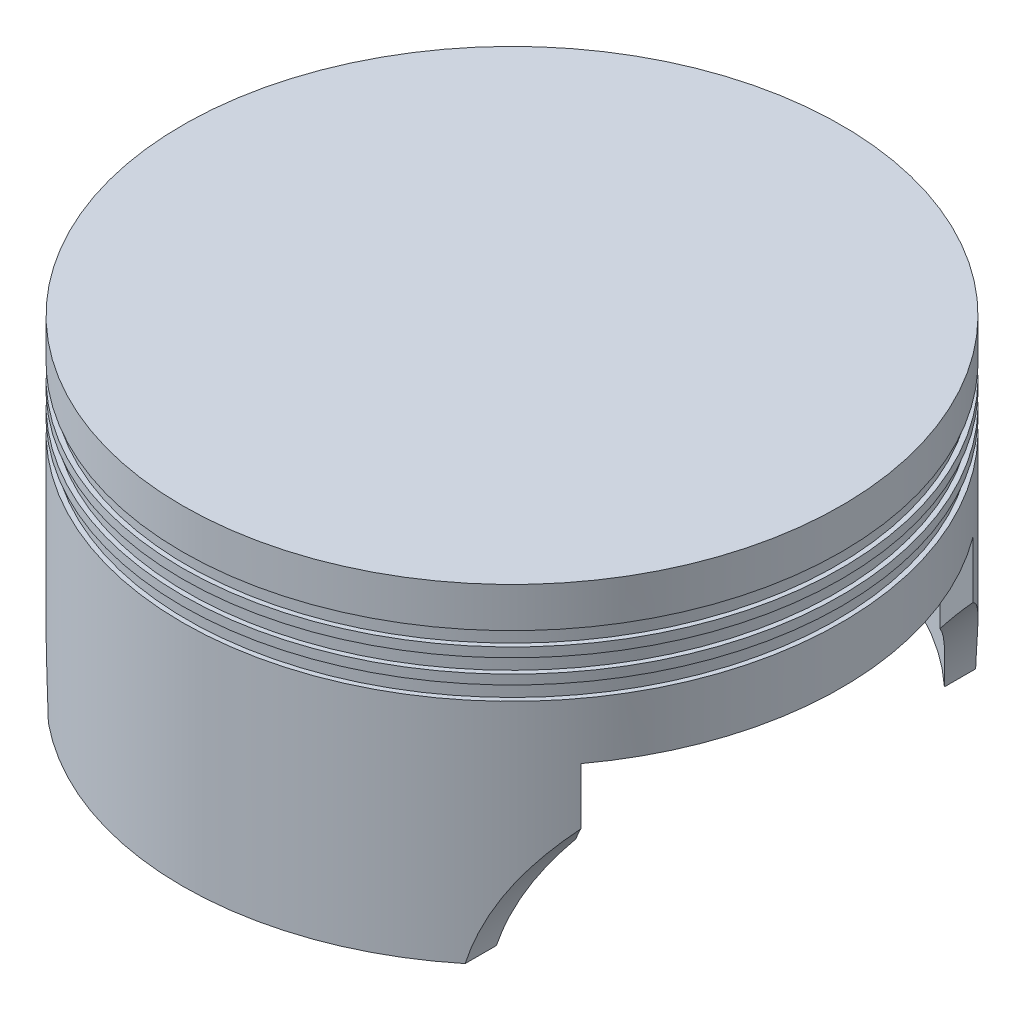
ISO-10303-21;
HEADER;
FILE_DESCRIPTION(('STEP AP214'),'2;1');
FILE_NAME('part.step','',(''),(''),'','','');
FILE_SCHEMA(('AUTOMOTIVE_DESIGN { 1 0 10303 214 1 1 1 1 }'));
ENDSEC;
DATA;
#1=APPLICATION_CONTEXT('core data for automotive mechanical design processes');
#2=APPLICATION_PROTOCOL_DEFINITION('international standard','automotive_design',2000,#1);
#3=PRODUCT_CONTEXT('',#1,'mechanical');
#4=PRODUCT('Part','Part','',(#3));
#5=PRODUCT_RELATED_PRODUCT_CATEGORY('part','',(#4));
#6=PRODUCT_DEFINITION_FORMATION('','',#4);
#7=PRODUCT_DEFINITION_CONTEXT('part definition',#1,'design');
#8=PRODUCT_DEFINITION('design','',#6,#7);
#9=PRODUCT_DEFINITION_SHAPE('','',#8);
#10=(LENGTH_UNIT() NAMED_UNIT(*) SI_UNIT(.MILLI.,.METRE.));
#11=(NAMED_UNIT(*) PLANE_ANGLE_UNIT() SI_UNIT($,.RADIAN.));
#12=(NAMED_UNIT(*) SI_UNIT($,.STERADIAN.) SOLID_ANGLE_UNIT());
#13=UNCERTAINTY_MEASURE_WITH_UNIT(LENGTH_MEASURE(1.E-05),#10,'distance_accuracy_value','');
#14=(GEOMETRIC_REPRESENTATION_CONTEXT(3) GLOBAL_UNCERTAINTY_ASSIGNED_CONTEXT((#13)) GLOBAL_UNIT_ASSIGNED_CONTEXT((#10,
#11,#12)) REPRESENTATION_CONTEXT('',''));
#15=CARTESIAN_POINT('',(0.,0.,0.));
#16=DIRECTION('',(0.,0.,1.));
#17=DIRECTION('',(1.,0.,0.));
#18=AXIS2_PLACEMENT_3D('',#15,#16,#17);
#19=CARTESIAN_POINT('',(0.,-70.,0.));
#20=DIRECTION('',(0.,1.,0.));
#21=DIRECTION('',(0.,0.,1.));
#22=AXIS2_PLACEMENT_3D('',#19,#20,#21);
#23=PLANE('',#22);
#24=CARTESIAN_POINT('',(0.,-70.,0.));
#25=DIRECTION('',(0.,-1.,0.));
#26=DIRECTION('',(0.,0.,-1.));
#27=AXIS2_PLACEMENT_3D('',#24,#25,#26);
#28=CIRCLE('',#27,65.);
#29=CARTESIAN_POINT('',(-44.2699802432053,-70.,-47.5937900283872));
#30=VERTEX_POINT('',#29);
#31=CARTESIAN_POINT('',(44.2699802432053,-70.,-47.5937900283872));
#32=VERTEX_POINT('',#31);
#33=EDGE_CURVE('E177',#30,#32,#28,.T.);
#34=ORIENTED_EDGE('',*,*,#33,.F.);
#35=DIRECTION('',(0.,0.,1.));
#36=VECTOR('',#35,1.);
#37=CARTESIAN_POINT('',(-44.2699802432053,-70.,-70.));
#38=LINE('',#37,#36);
#39=CARTESIAN_POINT('',(-44.2699802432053,-70.,-54.2233238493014));
#40=VERTEX_POINT('',#39);
#41=EDGE_CURVE('E312',#40,#30,#38,.T.);
#42=ORIENTED_EDGE('',*,*,#41,.F.);
#43=CARTESIAN_POINT('',(0.,-70.,0.));
#44=DIRECTION('',(0.,1.,0.));
#45=DIRECTION('',(0.,0.,1.));
#46=AXIS2_PLACEMENT_3D('',#43,#44,#45);
#47=CIRCLE('',#46,70.);
#48=CARTESIAN_POINT('',(44.2699802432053,-70.,-54.2233238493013));
#49=VERTEX_POINT('',#48);
#50=EDGE_CURVE('E145',#49,#40,#47,.T.);
#51=ORIENTED_EDGE('',*,*,#50,.F.);
#52=DIRECTION('',(0.,0.,1.));
#53=VECTOR('',#52,1.);
#54=CARTESIAN_POINT('',(44.2699802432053,-70.,-70.));
#55=LINE('',#54,#53);
#56=EDGE_CURVE('E251',#49,#32,#55,.T.);
#57=ORIENTED_EDGE('',*,*,#56,.T.);
#58=EDGE_LOOP('',(#34,#42,#51,#57));
#59=FACE_BOUND('',#58,.T.);
#60=ADVANCED_FACE('F40',(#59),#23,.F.);
#61=CARTESIAN_POINT('',(-44.2699802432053,-70.,54.2233238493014));
#62=VERTEX_POINT('',#61);
#63=CARTESIAN_POINT('',(44.2699802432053,-70.,54.2233238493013));
#64=VERTEX_POINT('',#63);
#65=EDGE_CURVE('E212',#62,#64,#47,.T.);
#66=ORIENTED_EDGE('',*,*,#65,.F.);
#67=CARTESIAN_POINT('',(-44.2699802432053,-70.,47.5937900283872));
#68=VERTEX_POINT('',#67);
#69=EDGE_CURVE('E313',#68,#62,#38,.T.);
#70=ORIENTED_EDGE('',*,*,#69,.F.);
#71=CARTESIAN_POINT('',(44.2699802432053,-70.,47.5937900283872));
#72=VERTEX_POINT('',#71);
#73=EDGE_CURVE('E179',#72,#68,#28,.T.);
#74=ORIENTED_EDGE('',*,*,#73,.F.);
#75=EDGE_CURVE('E146',#72,#64,#55,.T.);
#76=ORIENTED_EDGE('',*,*,#75,.T.);
#77=EDGE_LOOP('',(#66,#70,#74,#76));
#78=FACE_BOUND('',#77,.T.);
#79=ADVANCED_FACE('F329',(#78),#23,.F.);
#80=CARTESIAN_POINT('',(0.,-70.,0.));
#81=DIRECTION('',(0.,1.,0.));
#82=DIRECTION('',(0.,0.,1.));
#83=AXIS2_PLACEMENT_3D('',#80,#81,#82);
#84=CYLINDRICAL_SURFACE('',#83,70.);
#85=CARTESIAN_POINT('',(0.,-16.5,0.));
#86=DIRECTION('',(0.,1.,0.));
#87=DIRECTION('',(0.,0.,1.));
#88=AXIS2_PLACEMENT_3D('',#85,#86,#87);
#89=CIRCLE('',#88,70.);
#90=CARTESIAN_POINT('',(0.,-16.5,70.));
#91=VERTEX_POINT('',#90);
#92=EDGE_CURVE('E203',#91,#91,#89,.F.);
#93=ORIENTED_EDGE('',*,*,#92,.T.);
#94=EDGE_LOOP('',(#93));
#95=FACE_BOUND('',#94,.T.);
#96=CARTESIAN_POINT('',(0.,-18.5,0.));
#97=DIRECTION('',(0.,-1.,0.));
#98=DIRECTION('',(0.,0.,-1.));
#99=AXIS2_PLACEMENT_3D('',#96,#97,#98);
#100=CIRCLE('',#99,70.);
#101=CARTESIAN_POINT('',(0.,-18.5,-70.));
#102=VERTEX_POINT('',#101);
#103=EDGE_CURVE('E200',#102,#102,#100,.F.);
#104=ORIENTED_EDGE('',*,*,#103,.T.);
#105=EDGE_LOOP('',(#104));
#106=FACE_BOUND('',#105,.T.);
#107=ADVANCED_FACE('F342',(#95,#106),#84,.T.);
#108=CARTESIAN_POINT('',(0.,-11.5,0.));
#109=DIRECTION('',(0.,1.,0.));
#110=DIRECTION('',(0.,0.,1.));
#111=AXIS2_PLACEMENT_3D('',#108,#109,#110);
#112=CIRCLE('',#111,70.);
#113=CARTESIAN_POINT('',(0.,-11.5,70.));
#114=VERTEX_POINT('',#113);
#115=EDGE_CURVE('E211',#114,#114,#112,.F.);
#116=ORIENTED_EDGE('',*,*,#115,.T.);
#117=EDGE_LOOP('',(#116));
#118=FACE_BOUND('',#117,.T.);
#119=CARTESIAN_POINT('',(0.,-13.5,0.));
#120=DIRECTION('',(0.,-1.,0.));
#121=DIRECTION('',(0.,0.,-1.));
#122=AXIS2_PLACEMENT_3D('',#119,#120,#121);
#123=CIRCLE('',#122,70.);
#124=CARTESIAN_POINT('',(0.,-13.5,-70.));
#125=VERTEX_POINT('',#124);
#126=EDGE_CURVE('E208',#125,#125,#123,.F.);
#127=ORIENTED_EDGE('',*,*,#126,.T.);
#128=EDGE_LOOP('',(#127));
#129=FACE_BOUND('',#128,.T.);
#130=ADVANCED_FACE('F356',(#118,#129),#84,.T.);
#131=CARTESIAN_POINT('',(0.,0.,0.));
#132=DIRECTION('',(0.,1.,0.));
#133=DIRECTION('',(0.,0.,1.));
#134=AXIS2_PLACEMENT_3D('',#131,#132,#133);
#135=CIRCLE('',#134,70.);
#136=CARTESIAN_POINT('',(0.,0.,70.));
#137=VERTEX_POINT('',#136);
#138=EDGE_CURVE('E214',#137,#137,#135,.T.);
#139=ORIENTED_EDGE('',*,*,#138,.F.);
#140=EDGE_LOOP('',(#139));
#141=FACE_BOUND('',#140,.T.);
#142=CARTESIAN_POINT('',(0.,-8.5,0.));
#143=DIRECTION('',(0.,-1.,0.));
#144=DIRECTION('',(0.,0.,-1.));
#145=AXIS2_PLACEMENT_3D('',#142,#143,#144);
#146=CIRCLE('',#145,70.);
#147=CARTESIAN_POINT('',(0.,-8.5,-70.));
#148=VERTEX_POINT('',#147);
#149=EDGE_CURVE('E217',#148,#148,#146,.F.);
#150=ORIENTED_EDGE('',*,*,#149,.T.);
#151=EDGE_LOOP('',(#150));
#152=FACE_BOUND('',#151,.T.);
#153=ADVANCED_FACE('F42',(#141,#152),#84,.T.);
#154=CARTESIAN_POINT('',(0.,0.,0.));
#155=DIRECTION('',(0.,1.,0.));
#156=DIRECTION('',(0.,0.,1.));
#157=AXIS2_PLACEMENT_3D('',#154,#155,#156);
#158=PLANE('',#157);
#159=ORIENTED_EDGE('',*,*,#138,.T.);
#160=EDGE_LOOP('',(#159));
#161=FACE_BOUND('',#160,.T.);
#162=ADVANCED_FACE('F346',(#161),#158,.T.);
#163=CARTESIAN_POINT('',(0.,-70.,0.));
#164=DIRECTION('',(0.,-1.,0.));
#165=DIRECTION('',(0.,0.,-1.));
#166=AXIS2_PLACEMENT_3D('',#163,#164,#165);
#167=CYLINDRICAL_SURFACE('',#166,69.);
#168=CARTESIAN_POINT('',(0.,-8.5,0.));
#169=DIRECTION('',(0.,-1.,0.));
#170=DIRECTION('',(0.,0.,-1.));
#171=AXIS2_PLACEMENT_3D('',#168,#169,#170);
#172=CIRCLE('',#171,69.);
#173=CARTESIAN_POINT('',(0.,-8.5,-69.));
#174=VERTEX_POINT('',#173);
#175=EDGE_CURVE('E207',#174,#174,#172,.T.);
#176=ORIENTED_EDGE('',*,*,#175,.T.);
#177=EDGE_LOOP('',(#176));
#178=FACE_BOUND('',#177,.T.);
#179=CARTESIAN_POINT('',(0.,-11.5,0.));
#180=DIRECTION('',(0.,-1.,0.));
#181=DIRECTION('',(0.,0.,-1.));
#182=AXIS2_PLACEMENT_3D('',#179,#180,#181);
#183=CIRCLE('',#182,69.);
#184=CARTESIAN_POINT('',(0.,-11.5,-69.));
#185=VERTEX_POINT('',#184);
#186=EDGE_CURVE('E204',#185,#185,#183,.T.);
#187=ORIENTED_EDGE('',*,*,#186,.F.);
#188=EDGE_LOOP('',(#187));
#189=FACE_BOUND('',#188,.T.);
#190=ADVANCED_FACE('F344',(#178,#189),#167,.T.);
#191=CARTESIAN_POINT('',(0.,-8.5,71.));
#192=DIRECTION('',(0.,-1.,0.));
#193=DIRECTION('',(0.,0.,-1.));
#194=AXIS2_PLACEMENT_3D('',#191,#192,#193);
#195=PLANE('',#194);
#196=ORIENTED_EDGE('',*,*,#149,.F.);
#197=EDGE_LOOP('',(#196));
#198=FACE_BOUND('',#197,.T.);
#199=ORIENTED_EDGE('',*,*,#175,.F.);
#200=EDGE_LOOP('',(#199));
#201=FACE_BOUND('',#200,.T.);
#202=ADVANCED_FACE('F353',(#198,#201),#195,.T.);
#203=CARTESIAN_POINT('',(0.,-11.5,71.));
#204=DIRECTION('',(0.,1.,0.));
#205=DIRECTION('',(0.,0.,1.));
#206=AXIS2_PLACEMENT_3D('',#203,#204,#205);
#207=PLANE('',#206);
#208=ORIENTED_EDGE('',*,*,#115,.F.);
#209=EDGE_LOOP('',(#208));
#210=FACE_BOUND('',#209,.T.);
#211=ORIENTED_EDGE('',*,*,#186,.T.);
#212=EDGE_LOOP('',(#211));
#213=FACE_BOUND('',#212,.T.);
#214=ADVANCED_FACE('F364',(#210,#213),#207,.T.);
#215=CARTESIAN_POINT('',(0.,-75.,0.));
#216=DIRECTION('',(0.,-1.,0.));
#217=DIRECTION('',(0.,0.,-1.));
#218=AXIS2_PLACEMENT_3D('',#215,#216,#217);
#219=CYLINDRICAL_SURFACE('',#218,69.);
#220=CARTESIAN_POINT('',(0.,-13.5,0.));
#221=DIRECTION('',(0.,-1.,0.));
#222=DIRECTION('',(0.,0.,-1.));
#223=AXIS2_PLACEMENT_3D('',#220,#221,#222);
#224=CIRCLE('',#223,69.);
#225=CARTESIAN_POINT('',(0.,-13.5,-69.));
#226=VERTEX_POINT('',#225);
#227=EDGE_CURVE('E199',#226,#226,#224,.T.);
#228=ORIENTED_EDGE('',*,*,#227,.T.);
#229=EDGE_LOOP('',(#228));
#230=FACE_BOUND('',#229,.T.);
#231=CARTESIAN_POINT('',(0.,-16.5,0.));
#232=DIRECTION('',(0.,-1.,0.));
#233=DIRECTION('',(0.,0.,-1.));
#234=AXIS2_PLACEMENT_3D('',#231,#232,#233);
#235=CIRCLE('',#234,69.);
#236=CARTESIAN_POINT('',(0.,-16.5,-69.));
#237=VERTEX_POINT('',#236);
#238=EDGE_CURVE('E196',#237,#237,#235,.T.);
#239=ORIENTED_EDGE('',*,*,#238,.F.);
#240=EDGE_LOOP('',(#239));
#241=FACE_BOUND('',#240,.T.);
#242=ADVANCED_FACE('F370',(#230,#241),#219,.T.);
#243=CARTESIAN_POINT('',(0.,-13.5,71.));
#244=DIRECTION('',(0.,-1.,0.));
#245=DIRECTION('',(0.,0.,-1.));
#246=AXIS2_PLACEMENT_3D('',#243,#244,#245);
#247=PLANE('',#246);
#248=ORIENTED_EDGE('',*,*,#126,.F.);
#249=EDGE_LOOP('',(#248));
#250=FACE_BOUND('',#249,.T.);
#251=ORIENTED_EDGE('',*,*,#227,.F.);
#252=EDGE_LOOP('',(#251));
#253=FACE_BOUND('',#252,.T.);
#254=ADVANCED_FACE('F376',(#250,#253),#247,.T.);
#255=CARTESIAN_POINT('',(0.,-16.5,71.));
#256=DIRECTION('',(0.,1.,0.));
#257=DIRECTION('',(0.,0.,1.));
#258=AXIS2_PLACEMENT_3D('',#255,#256,#257);
#259=PLANE('',#258);
#260=ORIENTED_EDGE('',*,*,#92,.F.);
#261=EDGE_LOOP('',(#260));
#262=FACE_BOUND('',#261,.T.);
#263=ORIENTED_EDGE('',*,*,#238,.T.);
#264=EDGE_LOOP('',(#263));
#265=FACE_BOUND('',#264,.T.);
#266=ADVANCED_FACE('F383',(#262,#265),#259,.T.);
#267=CARTESIAN_POINT('',(0.,-80.,0.));
#268=DIRECTION('',(0.,-1.,0.));
#269=DIRECTION('',(0.,0.,-1.));
#270=AXIS2_PLACEMENT_3D('',#267,#268,#269);
#271=CYLINDRICAL_SURFACE('',#270,69.);
#272=CARTESIAN_POINT('',(0.,-18.5,0.));
#273=DIRECTION('',(0.,-1.,0.));
#274=DIRECTION('',(0.,0.,-1.));
#275=AXIS2_PLACEMENT_3D('',#272,#273,#274);
#276=CIRCLE('',#275,69.);
#277=CARTESIAN_POINT('',(0.,-18.5,-69.));
#278=VERTEX_POINT('',#277);
#279=EDGE_CURVE('E192',#278,#278,#276,.T.);
#280=ORIENTED_EDGE('',*,*,#279,.T.);
#281=EDGE_LOOP('',(#280));
#282=FACE_BOUND('',#281,.T.);
#283=CARTESIAN_POINT('',(0.,-21.5,0.));
#284=DIRECTION('',(0.,-1.,0.));
#285=DIRECTION('',(0.,0.,-1.));
#286=AXIS2_PLACEMENT_3D('',#283,#284,#285);
#287=CIRCLE('',#286,69.);
#288=CARTESIAN_POINT('',(0.,-21.5,-69.));
#289=VERTEX_POINT('',#288);
#290=EDGE_CURVE('E189',#289,#289,#287,.T.);
#291=ORIENTED_EDGE('',*,*,#290,.F.);
#292=EDGE_LOOP('',(#291));
#293=FACE_BOUND('',#292,.T.);
#294=ADVANCED_FACE('F387',(#282,#293),#271,.T.);
#295=CARTESIAN_POINT('',(0.,-18.5,71.));
#296=DIRECTION('',(0.,-1.,0.));
#297=DIRECTION('',(0.,0.,-1.));
#298=AXIS2_PLACEMENT_3D('',#295,#296,#297);
#299=PLANE('',#298);
#300=ORIENTED_EDGE('',*,*,#103,.F.);
#301=EDGE_LOOP('',(#300));
#302=FACE_BOUND('',#301,.T.);
#303=ORIENTED_EDGE('',*,*,#279,.F.);
#304=EDGE_LOOP('',(#303));
#305=FACE_BOUND('',#304,.T.);
#306=ADVANCED_FACE('F391',(#302,#305),#299,.T.);
#307=CARTESIAN_POINT('',(0.,-21.5,71.));
#308=DIRECTION('',(0.,1.,0.));
#309=DIRECTION('',(0.,0.,1.));
#310=AXIS2_PLACEMENT_3D('',#307,#308,#309);
#311=PLANE('',#310);
#312=CARTESIAN_POINT('',(0.,-21.5,0.));
#313=DIRECTION('',(0.,1.,0.));
#314=DIRECTION('',(0.,0.,1.));
#315=AXIS2_PLACEMENT_3D('',#312,#313,#314);
#316=CIRCLE('',#315,70.);
#317=CARTESIAN_POINT('',(0.,-21.5,70.));
#318=VERTEX_POINT('',#317);
#319=EDGE_CURVE('E195',#318,#318,#316,.F.);
#320=ORIENTED_EDGE('',*,*,#319,.F.);
#321=EDGE_LOOP('',(#320));
#322=FACE_BOUND('',#321,.T.);
#323=ORIENTED_EDGE('',*,*,#290,.T.);
#324=EDGE_LOOP('',(#323));
#325=FACE_BOUND('',#324,.T.);
#326=ADVANCED_FACE('F395',(#322,#325),#311,.T.);
#327=CARTESIAN_POINT('',(-43.1202707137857,-81.1868769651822,-55.142018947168));
#328=CARTESIAN_POINT('',(-43.1202742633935,-82.3914985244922,-55.1420193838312));
#329=CARTESIAN_POINT('',(-43.1598985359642,-83.5961745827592,-55.1111001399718));
#330=CARTESIAN_POINT('',(-43.3178200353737,-85.9971858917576,-54.9870569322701));
#331=CARTESIAN_POINT('',(-43.4361218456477,-87.1935206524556,-54.8939293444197));
#332=CARTESIAN_POINT('',(-43.7496459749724,-89.569686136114,-54.6443830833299));
#333=CARTESIAN_POINT('',(-43.9448854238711,-90.7495131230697,-54.4879503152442));
#334=CARTESIAN_POINT('',(-44.4092318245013,-93.0839583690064,-54.1101618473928));
#335=CARTESIAN_POINT('',(-44.6783373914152,-94.2385771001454,-53.8888073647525));
#336=CARTESIAN_POINT('',(-45.2862726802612,-96.5152123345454,-53.3789367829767));
#337=CARTESIAN_POINT('',(-45.6251588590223,-97.6372015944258,-53.0903662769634));
#338=CARTESIAN_POINT('',(-46.3666914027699,-99.8394067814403,-52.4439858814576));
#339=CARTESIAN_POINT('',(-46.7693377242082,-100.919622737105,-52.0861760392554));
#340=CARTESIAN_POINT('',(-47.630932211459,-103.030074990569,-51.2994566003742));
#341=CARTESIAN_POINT('',(-48.0898597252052,-104.060329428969,-50.8705730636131));
#342=CARTESIAN_POINT('',(-49.0554067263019,-106.064094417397,-49.9401267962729));
#343=CARTESIAN_POINT('',(-49.5620253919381,-107.037605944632,-49.438565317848));
#344=CARTESIAN_POINT('',(-50.6060241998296,-108.909243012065,-48.3692152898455));
#345=CARTESIAN_POINT('',(-51.1429102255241,-109.808193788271,-47.802387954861));
#346=CARTESIAN_POINT('',(-52.2428505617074,-111.540043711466,-46.5977416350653));
#347=CARTESIAN_POINT('',(-52.805904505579,-112.372943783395,-45.9599236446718));
#348=CARTESIAN_POINT('',(-53.9471041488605,-113.96940774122,-44.6148804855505));
#349=CARTESIAN_POINT('',(-54.5252497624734,-114.732972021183,-43.9076557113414));
#350=CARTESIAN_POINT('',(-55.6854809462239,-116.189098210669,-42.4265486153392));
#351=CARTESIAN_POINT('',(-56.2675665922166,-116.881658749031,-41.6526650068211));
#352=CARTESIAN_POINT('',(-57.4340793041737,-118.206130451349,-40.0292544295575));
#353=CARTESIAN_POINT('',(-58.0183965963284,-118.836902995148,-39.1787208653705));
#354=CARTESIAN_POINT('',(-59.1694467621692,-120.026529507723,-37.4176848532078));
#355=CARTESIAN_POINT('',(-59.7361795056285,-120.585382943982,-36.5071819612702));
#356=CARTESIAN_POINT('',(-60.8428662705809,-121.634085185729,-34.631371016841));
#357=CARTESIAN_POINT('',(-61.3828112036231,-122.123910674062,-33.6660445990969));
#358=CARTESIAN_POINT('',(-62.4276292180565,-123.038009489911,-31.6866511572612));
#359=CARTESIAN_POINT('',(-62.9325004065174,-123.462279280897,-30.6725815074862));
#360=CARTESIAN_POINT('',(-63.9516329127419,-124.291174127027,-28.4918612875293));
#361=CARTESIAN_POINT('',(-64.4612242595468,-124.68895806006,-27.3204264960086));
#362=CARTESIAN_POINT('',(-65.4217292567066,-125.415466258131,-24.9329790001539));
#363=CARTESIAN_POINT('',(-65.8726394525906,-125.744186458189,-23.7169636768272));
#364=CARTESIAN_POINT('',(-66.7101834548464,-126.338512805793,-21.2474118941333));
#365=CARTESIAN_POINT('',(-67.0967890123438,-126.604091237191,-19.9938592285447));
#366=CARTESIAN_POINT('',(-67.8011527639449,-127.077304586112,-17.4567122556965));
#367=CARTESIAN_POINT('',(-68.1189071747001,-127.284936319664,-16.1731163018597));
#368=CARTESIAN_POINT('',(-68.5624876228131,-127.569783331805,-14.1338630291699));
#369=CARTESIAN_POINT('',(-68.7124703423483,-127.664911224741,-13.3858144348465));
#370=CARTESIAN_POINT('',(-68.988196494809,-127.838231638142,-11.8832645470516));
#371=CARTESIAN_POINT('',(-69.1139393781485,-127.916423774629,-11.1287631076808));
#372=CARTESIAN_POINT('',(-69.3408005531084,-128.056481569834,-9.61454884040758));
#373=CARTESIAN_POINT('',(-69.4419180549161,-128.118346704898,-8.85483584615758));
#374=CARTESIAN_POINT('',(-69.6192482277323,-128.22624875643,-7.33133207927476));
#375=CARTESIAN_POINT('',(-69.6954590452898,-128.272284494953,-6.56754100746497));
#376=CARTESIAN_POINT('',(-69.8227868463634,-128.348916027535,-5.03672818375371));
#377=CARTESIAN_POINT('',(-69.8738917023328,-128.379504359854,-4.26970505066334));
#378=CARTESIAN_POINT('',(-69.9508164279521,-128.425461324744,-2.73393659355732));
#379=CARTESIAN_POINT('',(-69.9766362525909,-128.440829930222,-1.96519126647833));
#380=CARTESIAN_POINT('',(-70.00292335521,-128.456476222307,-0.427065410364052));
#381=CARTESIAN_POINT('',(-70.0033890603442,-128.45675297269,0.342315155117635));
#382=CARTESIAN_POINT('',(-69.9789641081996,-128.442215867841,1.88047619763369));
#383=CARTESIAN_POINT('',(-69.954075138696,-128.427403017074,2.64925671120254));
#384=CARTESIAN_POINT('',(-69.8756783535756,-128.380576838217,4.25325594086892));
#385=CARTESIAN_POINT('',(-69.8198283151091,-128.347154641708,5.08832049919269));
#386=CARTESIAN_POINT('',(-69.678329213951,-128.261952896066,6.75499179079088));
#387=CARTESIAN_POINT('',(-69.5926796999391,-128.210173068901,7.58659847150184));
#388=CARTESIAN_POINT('',(-69.3918528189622,-128.08774944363,9.2449112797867));
#389=CARTESIAN_POINT('',(-69.2766732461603,-128.0171042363,10.0716170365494));
#390=CARTESIAN_POINT('',(-69.0171785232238,-127.856281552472,11.7185312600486));
#391=CARTESIAN_POINT('',(-68.8728634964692,-127.766104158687,12.5387397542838));
#392=CARTESIAN_POINT('',(-68.5555548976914,-127.565350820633,14.1713672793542));
#393=CARTESIAN_POINT('',(-68.38255178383,-127.454768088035,14.9837836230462));
#394=CARTESIAN_POINT('',(-68.008547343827,-127.212237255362,16.5989344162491));
#395=CARTESIAN_POINT('',(-67.8075459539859,-127.080289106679,17.4016688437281));
#396=CARTESIAN_POINT('',(-67.3783529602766,-126.793905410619,18.9957587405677));
#397=CARTESIAN_POINT('',(-67.1501621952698,-126.639470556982,19.7871145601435));
#398=CARTESIAN_POINT('',(-66.6675611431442,-126.306860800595,21.3567418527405));
#399=CARTESIAN_POINT('',(-66.4131509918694,-126.128686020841,22.1350133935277));
#400=CARTESIAN_POINT('',(-65.8842040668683,-125.750760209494,23.6624763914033));
#401=CARTESIAN_POINT('',(-65.6101246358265,-125.551467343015,24.4119394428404));
#402=CARTESIAN_POINT('',(-65.0391491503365,-125.127357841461,25.8947923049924));
#403=CARTESIAN_POINT('',(-64.7422531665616,-124.902541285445,26.6281821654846));
#404=CARTESIAN_POINT('',(-64.1271731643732,-124.425987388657,28.0771279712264));
#405=CARTESIAN_POINT('',(-63.8089881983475,-124.174248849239,28.7926831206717));
#406=CARTESIAN_POINT('',(-63.1531340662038,-123.642472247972,30.2040923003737));
#407=CARTESIAN_POINT('',(-62.8154649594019,-123.362434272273,30.8999463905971));
#408=CARTESIAN_POINT('',(-62.123182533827,-122.773124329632,32.2691470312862));
#409=CARTESIAN_POINT('',(-61.7685935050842,-122.463893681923,32.9425236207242));
#410=CARTESIAN_POINT('',(-61.0443577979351,-121.814615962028,34.2659504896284));
#411=CARTESIAN_POINT('',(-60.6747109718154,-121.474568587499,34.9160005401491));
#412=CARTESIAN_POINT('',(-59.9230369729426,-120.762617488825,36.1908429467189));
#413=CARTESIAN_POINT('',(-59.5410119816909,-120.390719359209,36.8156397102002));
#414=CARTESIAN_POINT('',(-58.7674067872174,-119.614112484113,38.0383384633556));
#415=CARTESIAN_POINT('',(-58.3758270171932,-119.209405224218,38.6362416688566));
#416=CARTESIAN_POINT('',(-57.6392256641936,-118.423082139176,39.7252058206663));
#417=CARTESIAN_POINT('',(-57.2950064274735,-118.045653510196,40.2198385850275));
#418=CARTESIAN_POINT('',(-56.6038804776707,-117.265415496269,41.1868169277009));
#419=CARTESIAN_POINT('',(-56.2569735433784,-116.86260400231,41.6591606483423));
#420=CARTESIAN_POINT('',(-55.5628072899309,-116.031609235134,42.5805960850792));
#421=CARTESIAN_POINT('',(-55.2155480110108,-115.603428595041,43.0296902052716));
#422=CARTESIAN_POINT('',(-54.5229816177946,-114.721792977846,43.9039345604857));
#423=CARTESIAN_POINT('',(-54.1776744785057,-114.268338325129,44.3290851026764));
#424=CARTESIAN_POINT('',(-53.491571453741,-113.336739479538,45.1546200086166));
#425=CARTESIAN_POINT('',(-53.1507732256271,-112.858608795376,45.5550176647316));
#426=CARTESIAN_POINT('',(-52.4759167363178,-111.878034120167,46.3307939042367));
#427=CARTESIAN_POINT('',(-52.1418576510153,-111.375593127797,46.7061755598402));
#428=CARTESIAN_POINT('',(-51.4827933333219,-110.347102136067,47.4316580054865));
#429=CARTESIAN_POINT('',(-51.1577878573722,-109.821052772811,47.7817594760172));
#430=CARTESIAN_POINT('',(-50.5191100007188,-108.7462712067,48.4565304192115));
#431=CARTESIAN_POINT('',(-50.2054372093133,-108.197539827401,48.7812008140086));
#432=CARTESIAN_POINT('',(-49.6342139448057,-107.156174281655,49.3617955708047));
#433=CARTESIAN_POINT('',(-49.3749166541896,-106.666325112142,49.6210070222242));
#434=CARTESIAN_POINT('',(-48.867637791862,-105.671361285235,50.120661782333));
#435=CARTESIAN_POINT('',(-48.6196571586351,-105.166245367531,50.3611035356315));
#436=CARTESIAN_POINT('',(-48.1363322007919,-104.14175938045,50.8232753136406));
#437=CARTESIAN_POINT('',(-47.9009853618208,-103.622392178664,51.0450090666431));
#438=CARTESIAN_POINT('',(-47.4440089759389,-102.570177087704,51.4700242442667));
#439=CARTESIAN_POINT('',(-47.222380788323,-102.037327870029,51.6733038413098));
#440=CARTESIAN_POINT('',(-46.7939436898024,-100.959196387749,52.0616022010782));
#441=CARTESIAN_POINT('',(-46.5871340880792,-100.41391470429,52.2466218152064));
#442=CARTESIAN_POINT('',(-46.1892738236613,-99.3118549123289,52.5986839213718));
#443=CARTESIAN_POINT('',(-45.998224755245,-98.7550756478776,52.7657245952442));
#444=CARTESIAN_POINT('',(-45.6327965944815,-97.6311511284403,53.0820714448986));
#445=CARTESIAN_POINT('',(-45.4584160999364,-97.0640067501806,53.2313791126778));
#446=CARTESIAN_POINT('',(-45.1270740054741,-95.9203683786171,53.5125620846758));
#447=CARTESIAN_POINT('',(-44.9701140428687,-95.3438735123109,53.6444357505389));
#448=CARTESIAN_POINT('',(-44.5345913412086,-93.6340239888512,54.0075109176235));
#449=CARTESIAN_POINT('',(-44.2811910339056,-92.4889808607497,54.2148896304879));
#450=CARTESIAN_POINT('',(-43.8470436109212,-90.1758825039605,54.5666081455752));
#451=CARTESIAN_POINT('',(-43.6662945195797,-89.0078279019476,54.7109496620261));
#452=CARTESIAN_POINT('',(-43.3801068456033,-86.6565157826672,54.9381452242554));
#453=CARTESIAN_POINT('',(-43.2746721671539,-85.473257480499,55.0209960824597));
#454=CARTESIAN_POINT('',(-43.1406913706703,-83.0997142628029,55.1261098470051));
#455=CARTESIAN_POINT('',(-43.1121468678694,-81.9094292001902,55.1483714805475));
#456=CARTESIAN_POINT('',(-43.1325555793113,-79.5072911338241,55.1324124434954));
#457=CARTESIAN_POINT('',(-43.1829911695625,-78.2954579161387,55.0930348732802));
#458=CARTESIAN_POINT('',(-43.3633782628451,-75.8814289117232,54.9511650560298));
#459=CARTESIAN_POINT('',(-43.4933306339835,-74.679233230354,54.8486721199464));
#460=CARTESIAN_POINT('',(-43.83075292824,-72.2930530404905,54.5794066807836));
#461=CARTESIAN_POINT('',(-44.0382221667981,-71.109068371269,54.4126347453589));
#462=CARTESIAN_POINT('',(-44.5273776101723,-68.7678648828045,54.0130750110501));
#463=CARTESIAN_POINT('',(-44.8090632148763,-67.6106458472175,53.7802877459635));
#464=CARTESIAN_POINT('',(-45.4419547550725,-65.3314768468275,53.2465955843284));
#465=CARTESIAN_POINT('',(-45.7931588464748,-64.2095259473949,52.9456924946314));
#466=CARTESIAN_POINT('',(-46.5589335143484,-62.0091432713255,52.2735597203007));
#467=CARTESIAN_POINT('',(-46.9735038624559,-60.9307113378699,51.9023302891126));
#468=CARTESIAN_POINT('',(-47.858202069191,-58.8255804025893,51.0877058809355));
#469=CARTESIAN_POINT('',(-48.3283111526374,-57.7988640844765,50.6443352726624));
#470=CARTESIAN_POINT('',(-49.31509832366,-55.8039397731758,49.6839488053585));
#471=CARTESIAN_POINT('',(-49.8317754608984,-54.8357305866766,49.1669344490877));
#472=CARTESIAN_POINT('',(-50.8911778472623,-52.9817150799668,48.0693082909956));
#473=CARTESIAN_POINT('',(-51.433221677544,-52.0946926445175,47.4900914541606));
#474=CARTESIAN_POINT('',(-52.5415074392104,-50.3873266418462,46.260938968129));
#475=CARTESIAN_POINT('',(-53.107748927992,-49.566981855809,45.6110046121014));
#476=CARTESIAN_POINT('',(-54.2533253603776,-47.9959680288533,44.2422075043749));
#477=CARTESIAN_POINT('',(-54.8326602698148,-47.2452988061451,43.5233449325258));
#478=CARTESIAN_POINT('',(-55.993323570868,-45.8150123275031,42.019634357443));
#479=CARTESIAN_POINT('',(-56.5746520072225,-45.1353966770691,41.2347848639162));
#480=CARTESIAN_POINT('',(-57.7396554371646,-43.8347301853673,39.5874860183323));
#481=CARTESIAN_POINT('',(-58.323163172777,-43.2150458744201,38.7238408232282));
#482=CARTESIAN_POINT('',(-59.4707537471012,-42.0475732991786,36.9372002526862));
#483=CARTESIAN_POINT('',(-60.034836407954,-41.4997856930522,36.0142043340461));
#484=CARTESIAN_POINT('',(-61.1345344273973,-40.4729772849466,34.1141321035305));
#485=CARTESIAN_POINT('',(-61.6701398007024,-39.9939805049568,33.1370370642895));
#486=CARTESIAN_POINT('',(-62.7047581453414,-39.1011489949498,31.1349223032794));
#487=CARTESIAN_POINT('',(-63.2037691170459,-38.6873178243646,30.1098999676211));
#488=CARTESIAN_POINT('',(-64.2109598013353,-37.8784404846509,27.9030527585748));
#489=CARTESIAN_POINT('',(-64.714139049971,-37.4904363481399,26.716362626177));
#490=CARTESIAN_POINT('',(-65.6599858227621,-36.7832882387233,24.2991993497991));
#491=CARTESIAN_POINT('',(-66.1026496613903,-36.4641484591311,23.0687235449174));
#492=CARTESIAN_POINT('',(-66.9220275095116,-35.8887495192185,20.5711122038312));
#493=CARTESIAN_POINT('',(-67.2987124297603,-35.6325180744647,19.303960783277));
#494=CARTESIAN_POINT('',(-67.981713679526,-35.1777915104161,16.740543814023));
#495=CARTESIAN_POINT('',(-68.2880261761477,-34.9792995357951,15.4442766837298));
#496=CARTESIAN_POINT('',(-68.7124184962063,-34.7088019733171,13.386259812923));
#497=CARTESIAN_POINT('',(-68.8551297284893,-34.6189155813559,12.6317909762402));
#498=CARTESIAN_POINT('',(-69.1159076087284,-34.4560447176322,11.116742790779));
#499=CARTESIAN_POINT('',(-69.2339736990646,-34.3830606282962,10.3561633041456));
#500=CARTESIAN_POINT('',(-69.445100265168,-34.2534143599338,8.83014547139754));
#501=CARTESIAN_POINT('',(-69.5381599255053,-34.1967527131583,8.06470696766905));
#502=CARTESIAN_POINT('',(-69.6990159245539,-34.0992869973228,6.5301161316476));
#503=CARTESIAN_POINT('',(-69.7668103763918,-34.058484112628,5.76096352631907));
#504=CARTESIAN_POINT('',(-69.8769664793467,-33.992386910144,4.21979724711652));
#505=CARTESIAN_POINT('',(-69.9193156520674,-33.9671002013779,3.4477823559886));
#506=CARTESIAN_POINT('',(-69.9784159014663,-33.9318540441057,1.9024238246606));
#507=CARTESIAN_POINT('',(-69.9951669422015,-33.921894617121,1.1290801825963));
#508=CARTESIAN_POINT('',(-70.0030263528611,-33.9172186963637,-0.417831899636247));
#509=CARTESIAN_POINT('',(-69.9941331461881,-33.9225031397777,-1.19140035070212));
#510=CARTESIAN_POINT('',(-69.9507263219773,-33.9483609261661,-2.73750642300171));
#511=CARTESIAN_POINT('',(-69.9162144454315,-33.968933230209,-3.51004411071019));
#512=CARTESIAN_POINT('',(-69.8176708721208,-34.0279281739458,-5.11813915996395));
#513=CARTESIAN_POINT('',(-69.7513928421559,-34.0677112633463,-5.95351032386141));
#514=CARTESIAN_POINT('',(-69.5890269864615,-34.165848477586,-7.6202659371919));
#515=CARTESIAN_POINT('',(-69.4929387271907,-34.2242028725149,-8.45165032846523));
#516=CARTESIAN_POINT('',(-69.271261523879,-34.360051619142,-10.1089727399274));
#517=CARTESIAN_POINT('',(-69.1456703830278,-34.4375473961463,-10.9349103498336));
#518=CARTESIAN_POINT('',(-68.8654235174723,-34.6124076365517,-12.5797225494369));
#519=CARTESIAN_POINT('',(-68.7107679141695,-34.7097720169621,-13.3985971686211));
#520=CARTESIAN_POINT('',(-68.3729023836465,-34.9252920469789,-15.0279280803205));
#521=CARTESIAN_POINT('',(-68.1896843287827,-35.043453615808,-15.8383819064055));
#522=CARTESIAN_POINT('',(-67.795427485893,-35.3015917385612,-17.4489935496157));
#523=CARTESIAN_POINT('',(-67.5843886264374,-35.4415683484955,-18.2491513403));
#524=CARTESIAN_POINT('',(-67.1353627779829,-35.7445088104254,-19.8374418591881));
#525=CARTESIAN_POINT('',(-66.8973767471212,-35.9074718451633,-20.6255750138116));
#526=CARTESIAN_POINT('',(-66.3954983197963,-36.257683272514,-22.1880846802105));
#527=CARTESIAN_POINT('',(-66.1316060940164,-36.4449315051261,-22.9624612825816));
#528=CARTESIAN_POINT('',(-65.5856988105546,-36.8403719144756,-24.4775214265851));
#529=CARTESIAN_POINT('',(-65.304259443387,-37.0479645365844,-25.2185687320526));
#530=CARTESIAN_POINT('',(-64.7192602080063,-37.4889746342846,-26.6840741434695));
#531=CARTESIAN_POINT('',(-64.4157004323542,-37.7223920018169,-27.4085323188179));
#532=CARTESIAN_POINT('',(-63.7880580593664,-38.2164374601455,-28.8391014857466));
#533=CARTESIAN_POINT('',(-63.4639746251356,-38.4770666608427,-29.5452117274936));
#534=CARTESIAN_POINT('',(-62.7971593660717,-39.0268897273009,-30.937232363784));
#535=CARTESIAN_POINT('',(-62.454427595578,-39.3160835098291,-31.6231428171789));
#536=CARTESIAN_POINT('',(-61.7529542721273,-39.9238991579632,-32.9719521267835));
#537=CARTESIAN_POINT('',(-61.3942366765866,-40.2424777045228,-33.6348829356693));
#538=CARTESIAN_POINT('',(-60.6627209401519,-40.9106144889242,-34.9369706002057));
#539=CARTESIAN_POINT('',(-60.2899226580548,-41.2601730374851,-35.5761272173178));
#540=CARTESIAN_POINT('',(-59.5329892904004,-41.9912331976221,-36.8287743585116));
#541=CARTESIAN_POINT('',(-59.1488562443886,-42.3727290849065,-37.4422694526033));
#542=CARTESIAN_POINT('',(-58.3721317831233,-43.1685322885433,-38.6420086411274));
#543=CARTESIAN_POINT('',(-57.9795407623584,-43.5828380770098,-39.2282540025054));
#544=CARTESIAN_POINT('',(-57.2436209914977,-44.3853334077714,-40.2930145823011));
#545=CARTESIAN_POINT('',(-56.9009694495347,-44.7692385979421,-40.7752331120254));
#546=CARTESIAN_POINT('',(-56.2138540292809,-45.5620624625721,-41.717413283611));
#547=CARTESIAN_POINT('',(-55.8693900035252,-45.9709832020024,-42.1773730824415));
#548=CARTESIAN_POINT('',(-55.1809599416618,-46.8137538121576,-43.0741358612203));
#549=CARTESIAN_POINT('',(-54.8369938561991,-47.247601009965,-43.5109413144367));
#550=CARTESIAN_POINT('',(-54.1518235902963,-48.140059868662,-44.3607701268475));
#551=CARTESIAN_POINT('',(-53.8106193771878,-48.5986712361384,-44.773793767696));
#552=CARTESIAN_POINT('',(-53.1334337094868,-49.5400675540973,-45.5753595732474));
#553=CARTESIAN_POINT('',(-52.7974501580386,-50.0228424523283,-45.9639117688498));
#554=CARTESIAN_POINT('',(-52.1329161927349,-51.012082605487,-46.7162814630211));
#555=CARTESIAN_POINT('',(-51.8043648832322,-51.5185449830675,-47.0801019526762));
#556=CARTESIAN_POINT('',(-51.1569348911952,-52.5544106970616,-47.7828030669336));
#557=CARTESIAN_POINT('',(-50.8380559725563,-53.0838134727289,-48.1216843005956));
#558=CARTESIAN_POINT('',(-50.2121676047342,-54.1645979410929,-48.7744059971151));
#559=CARTESIAN_POINT('',(-49.9051577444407,-54.7159788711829,-49.0882473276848));
#560=CARTESIAN_POINT('',(-49.3455874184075,-55.7637793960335,-49.65026020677));
#561=CARTESIAN_POINT('',(-49.0912692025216,-56.257577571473,-49.9015789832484));
#562=CARTESIAN_POINT('',(-48.5943327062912,-57.2600212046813,-50.3856244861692));
#563=CARTESIAN_POINT('',(-48.3517154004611,-57.7686678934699,-50.6183496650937));
#564=CARTESIAN_POINT('',(-47.8794519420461,-58.7997905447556,-51.0652892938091));
#565=CARTESIAN_POINT('',(-47.6498034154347,-59.3222639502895,-51.2795071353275));
#566=CARTESIAN_POINT('',(-47.2045196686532,-60.3802498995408,-51.689698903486));
#567=CARTESIAN_POINT('',(-46.9888858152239,-60.9157637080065,-51.8856710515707));
#568=CARTESIAN_POINT('',(-46.5727363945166,-61.9986497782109,-52.2595297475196));
#569=CARTESIAN_POINT('',(-46.3722165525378,-62.5460186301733,-52.4374214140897));
#570=CARTESIAN_POINT('',(-45.987133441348,-63.6518031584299,-52.7754602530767));
#571=CARTESIAN_POINT('',(-45.8025718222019,-64.2102199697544,-52.9356055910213));
#572=CARTESIAN_POINT('',(-45.4502797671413,-65.3369443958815,-53.2383887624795));
#573=CARTESIAN_POINT('',(-45.2825471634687,-65.9052507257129,-53.381028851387));
#574=CARTESIAN_POINT('',(-44.9646128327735,-67.0507688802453,-53.6491076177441));
#575=CARTESIAN_POINT('',(-44.8144125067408,-67.6279814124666,-53.7745449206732));
#576=CARTESIAN_POINT('',(-44.4189580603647,-69.2566595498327,-54.1023653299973));
#577=CARTESIAN_POINT('',(-44.1941288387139,-70.3170602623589,-54.2857358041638));
#578=CARTESIAN_POINT('',(-43.8066699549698,-72.456741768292,-54.5988793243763));
#579=CARTESIAN_POINT('',(-43.6440348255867,-73.5360208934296,-54.7286570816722));
#580=CARTESIAN_POINT('',(-43.3829860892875,-75.7073508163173,-54.9358204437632));
#581=CARTESIAN_POINT('',(-43.284573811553,-76.7994018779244,-55.0132049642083));
#582=CARTESIAN_POINT('',(-43.153211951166,-78.9899121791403,-55.1163060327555));
#583=CARTESIAN_POINT('',(-43.1202674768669,-80.0883719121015,-55.1420185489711));
#584=CARTESIAN_POINT('',(-43.1202707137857,-81.1868769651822,-55.142018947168));
#585=B_SPLINE_CURVE_WITH_KNOTS('',3,(#327,#328,#329,#330,#331,#332,#333,#334,#335,#336,#337,
#338,#339,#340,#341,#342,#343,#344,#345,#346,#347,#348,#349,#350,#351,#352,#353,#354,#355,#356,
#357,#358,#359,#360,#361,#362,#363,#364,#365,#366,#367,#368,#369,#370,#371,#372,#373,#374,#375,
#376,#377,#378,#379,#380,#381,#382,#383,#384,#385,#386,#387,#388,#389,#390,#391,#392,#393,#394,
#395,#396,#397,#398,#399,#400,#401,#402,#403,#404,#405,#406,#407,#408,#409,#410,#411,#412,#413,
#414,#415,#416,#417,#418,#419,#420,#421,#422,#423,#424,#425,#426,#427,#428,#429,#430,#431,#432,
#433,#434,#435,#436,#437,#438,#439,#440,#441,#442,#443,#444,#445,#446,#447,#448,#449,#450,#451,
#452,#453,#454,#455,#456,#457,#458,#459,#460,#461,#462,#463,#464,#465,#466,#467,#468,#469,#470,
#471,#472,#473,#474,#475,#476,#477,#478,#479,#480,#481,#482,#483,#484,#485,#486,#487,#488,#489,
#490,#491,#492,#493,#494,#495,#496,#497,#498,#499,#500,#501,#502,#503,#504,#505,#506,#507,#508,
#509,#510,#511,#512,#513,#514,#515,#516,#517,#518,#519,#520,#521,#522,#523,#524,#525,#526,#527,
#528,#529,#530,#531,#532,#533,#534,#535,#536,#537,#538,#539,#540,#541,#542,#543,#544,#545,#546,
#547,#548,#549,#550,#551,#552,#553,#554,#555,#556,#557,#558,#559,#560,#561,#562,#563,#564,#565,
#566,#567,#568,#569,#570,#571,#572,#573,#574,#575,#576,#577,#578,#579,#580,#581,#582,#583,#584),
.UNSPECIFIED.,.T.,.F.,(4,2,2,2,2,2,2,2,2,2,2,2,2,2,2,2,2,2,2,2,2,2,2,2,2,2,2,2,2,2,2,2,2,2,2,2,
2,2,2,2,2,2,2,2,2,2,2,2,2,2,2,2,2,2,2,2,2,2,2,2,2,2,2,2,2,2,2,2,2,2,2,2,2,2,2,2,2,2,2,2,2,2,2,2,
2,2,2,2,2,2,2,2,2,2,2,2,2,2,2,2,2,2,2,2,2,2,2,2,2,2,2,2,2,2,2,2,2,2,2,2,2,2,2,2,2,2,2,2,4),(0.,
3.61291121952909,7.22603293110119,10.8399595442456,14.4538184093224,18.0706126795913,
21.6874044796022,25.3028730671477,28.9182793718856,32.4859793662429,36.0536293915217,
39.6212591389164,43.1889577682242,46.8133486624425,50.437766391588,54.0634055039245,
57.689240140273,61.6991380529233,65.7092719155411,69.7211627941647,73.7332740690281,
76.0392900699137,78.3453583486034,80.6515005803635,82.9578143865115,85.2652411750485,
87.5726720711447,89.8802461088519,92.1876665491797,94.6997122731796,97.2117960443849,
99.7240675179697,102.236328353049,104.749426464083,107.262530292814,109.775556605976,
112.288569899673,114.755268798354,117.221960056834,119.688761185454,122.155554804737,
124.618907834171,127.082285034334,129.545230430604,132.008064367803,134.140459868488,
136.273032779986,138.405384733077,140.537709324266,142.668878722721,144.799785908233,
146.930635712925,149.061408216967,150.896435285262,152.731614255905,154.566426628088,
156.401420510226,158.236328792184,160.071422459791,161.906361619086,163.741473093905,
167.309798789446,170.878027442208,174.44644105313,178.014929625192,181.65120198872,
185.287514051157,188.923794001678,192.560044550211,196.196198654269,199.832339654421,
203.46725493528,207.102096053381,210.667876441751,214.233591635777,217.799297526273,
221.365083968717,224.99897743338,228.632904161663,232.268096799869,235.903487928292,
239.937722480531,243.972202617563,248.008457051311,252.044931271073,254.363682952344,
256.682487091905,259.001366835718,261.320419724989,263.64060895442,265.96080144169,
268.281136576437,270.601314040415,273.11738311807,275.633488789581,278.149781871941,
280.666064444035,283.18306435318,285.700070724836,288.216987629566,290.733887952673,
293.191305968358,295.648713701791,298.106221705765,300.563722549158,303.01765674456,
305.471615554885,307.925135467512,310.378541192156,312.493422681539,314.60847898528,
316.723308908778,318.838113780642,320.95204607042,323.065722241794,325.179346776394,
327.292898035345,329.121293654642,330.949841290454,332.778053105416,334.606442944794,
336.434313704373,338.262373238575,340.090196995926,341.918166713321,345.212776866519,
348.507097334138,351.801485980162,355.096131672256),.UNSPECIFIED.);
#586=CARTESIAN_POINT('',(-56.2699802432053,-45.4999999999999,41.6375950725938));
#587=VERTEX_POINT('',#586);
#588=EDGE_CURVE('E63',#62,#587,#585,.T.);
#589=ORIENTED_EDGE('',*,*,#588,.F.);
#590=ORIENTED_EDGE('',*,*,#65,.T.);
#591=CARTESIAN_POINT('',(70.,-128.454734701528,0.));
#592=CARTESIAN_POINT('',(70.0000043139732,-128.454730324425,-0.809917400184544));
#593=CARTESIAN_POINT('',(69.9859428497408,-128.446378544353,-1.61975920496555));
#594=CARTESIAN_POINT('',(69.92974769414,-128.41288312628,-3.23817653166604));
#595=CARTESIAN_POINT('',(69.8876134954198,-128.387739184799,-4.04675203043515));
#596=CARTESIAN_POINT('',(69.7753869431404,-128.320429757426,-5.66130176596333));
#597=CARTESIAN_POINT('',(69.7052924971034,-128.278262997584,-6.46727580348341));
#598=CARTESIAN_POINT('',(69.5373576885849,-128.176521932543,-8.07522636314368));
#599=CARTESIAN_POINT('',(69.4395174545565,-128.116947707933,-8.87720290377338));
#600=CARTESIAN_POINT('',(69.216337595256,-127.979823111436,-10.4761911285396));
#601=CARTESIAN_POINT('',(69.0909841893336,-127.902263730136,-11.273200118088));
#602=CARTESIAN_POINT('',(68.8132111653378,-127.728504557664,-12.8604465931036));
#603=CARTESIAN_POINT('',(68.6607915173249,-127.632304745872,-13.6506840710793));
#604=CARTESIAN_POINT('',(68.3294051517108,-127.420447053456,-15.2229373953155));
#605=CARTESIAN_POINT('',(68.1504387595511,-127.304789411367,-16.0049533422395));
#606=CARTESIAN_POINT('',(67.7666004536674,-127.053066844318,-17.559290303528));
#607=CARTESIAN_POINT('',(67.5617285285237,-126.917001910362,-18.3316113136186));
#608=CARTESIAN_POINT('',(67.1258294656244,-126.622700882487,-19.8686731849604));
#609=CARTESIAN_POINT('',(66.8946825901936,-126.464362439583,-20.6333605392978));
#610=CARTESIAN_POINT('',(66.4079863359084,-126.124823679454,-22.1497956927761));
#611=CARTESIAN_POINT('',(66.1524369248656,-125.943623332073,-22.9015434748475));
#612=CARTESIAN_POINT('',(65.6180639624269,-125.55708428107,-24.3904758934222));
#613=CARTESIAN_POINT('',(65.3392392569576,-125.351744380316,-25.127659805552));
#614=CARTESIAN_POINT('',(64.7596732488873,-124.915609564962,-26.5857133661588));
#615=CARTESIAN_POINT('',(64.4589320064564,-124.684814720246,-27.3065830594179));
#616=CARTESIAN_POINT('',(63.8373840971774,-124.196639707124,-28.7296130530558));
#617=CARTESIAN_POINT('',(63.5165957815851,-123.939283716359,-29.4317896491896));
#618=CARTESIAN_POINT('',(62.8565177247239,-123.396476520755,-30.8163321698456));
#619=CARTESIAN_POINT('',(62.5172278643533,-123.111025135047,-31.4986979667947));
#620=CARTESIAN_POINT('',(61.8222599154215,-122.510782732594,-32.8417386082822));
#621=CARTESIAN_POINT('',(61.466583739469,-122.195995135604,-33.5024159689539));
#622=CARTESIAN_POINT('',(60.7411487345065,-121.535875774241,-34.8003667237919));
#623=CARTESIAN_POINT('',(60.3713903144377,-121.190544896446,-35.4376407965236));
#624=CARTESIAN_POINT('',(59.6547982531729,-120.501395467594,-36.6298171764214));
#625=CARTESIAN_POINT('',(59.3089668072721,-120.160335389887,-37.186917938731));
#626=CARTESIAN_POINT('',(58.6099767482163,-119.451539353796,-38.2791191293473));
#627=CARTESIAN_POINT('',(58.2568183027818,-119.083804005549,-38.8142200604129));
#628=CARTESIAN_POINT('',(57.5454785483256,-118.321202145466,-39.8612401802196));
#629=CARTESIAN_POINT('',(57.1872973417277,-117.926336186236,-40.373159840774));
#630=CARTESIAN_POINT('',(56.4683470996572,-117.10920130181,-41.3727543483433));
#631=CARTESIAN_POINT('',(56.1075780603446,-116.686932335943,-41.8604291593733));
#632=CARTESIAN_POINT('',(55.3863521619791,-115.81535993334,-42.8101296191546));
#633=CARTESIAN_POINT('',(55.0258953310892,-115.366082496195,-43.2721791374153));
#634=CARTESIAN_POINT('',(54.3075851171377,-114.440324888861,-44.1703165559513));
#635=CARTESIAN_POINT('',(53.9497316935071,-113.963845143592,-44.6064048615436));
#636=CARTESIAN_POINT('',(53.2393325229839,-112.984163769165,-45.4519346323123));
#637=CARTESIAN_POINT('',(52.8867861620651,-112.48096526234,-45.8613791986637));
#638=CARTESIAN_POINT('',(52.1896290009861,-111.448471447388,-46.653197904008));
#639=CARTESIAN_POINT('',(51.8450178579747,-110.919177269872,-47.0355732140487));
#640=CARTESIAN_POINT('',(51.2177241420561,-109.91744555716,-47.7171415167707));
#641=CARTESIAN_POINT('',(50.9335641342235,-109.448530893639,-48.0201639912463));
#642=CARTESIAN_POINT('',(50.3743537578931,-108.49317233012,-48.6064667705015));
#643=CARTESIAN_POINT('',(50.0993041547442,-108.006726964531,-48.8897454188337));
#644=CARTESIAN_POINT('',(49.5598876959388,-107.017220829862,-49.4364742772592));
#645=CARTESIAN_POINT('',(49.2955186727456,-106.514163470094,-49.6999285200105));
#646=CARTESIAN_POINT('',(48.7787875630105,-105.492142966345,-50.2071806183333));
#647=CARTESIAN_POINT('',(48.5264267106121,-104.973178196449,-50.4509764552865));
#648=CARTESIAN_POINT('',(48.0350767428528,-103.920349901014,-50.9190193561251));
#649=CARTESIAN_POINT('',(47.7960870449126,-103.386487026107,-51.1432672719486));
#650=CARTESIAN_POINT('',(47.3326721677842,-102.304786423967,-51.572452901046));
#651=CARTESIAN_POINT('',(47.1082485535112,-101.756947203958,-51.7773885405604));
#652=CARTESIAN_POINT('',(46.67514143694,-100.64844570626,-52.1681537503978));
#653=CARTESIAN_POINT('',(46.4664563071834,-100.087784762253,-52.3539852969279));
#654=CARTESIAN_POINT('',(46.0658122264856,-98.9546769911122,-52.7068507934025));
#655=CARTESIAN_POINT('',(45.8738548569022,-98.3822290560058,-52.8738829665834));
#656=CARTESIAN_POINT('',(45.3434491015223,-96.7086993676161,-53.3308771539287));
#657=CARTESIAN_POINT('',(45.0278788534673,-95.5936016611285,-53.5968635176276));
#658=CARTESIAN_POINT('',(44.4655895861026,-93.3331635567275,-54.0642673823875));
#659=CARTESIAN_POINT('',(44.2188674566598,-92.1878245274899,-54.2656878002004));
#660=CARTESIAN_POINT('',(43.7980471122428,-89.8746721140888,-54.6059005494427));
#661=CARTESIAN_POINT('',(43.6239502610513,-88.706858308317,-54.7446917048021));
#662=CARTESIAN_POINT('',(43.3510198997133,-86.3568497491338,-54.9610718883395));
#663=CARTESIAN_POINT('',(43.2521883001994,-85.1746546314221,-55.0386593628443));
#664=CARTESIAN_POINT('',(43.1302208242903,-82.7840041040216,-55.1342928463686));
#665=CARTESIAN_POINT('',(43.1083845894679,-81.5754411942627,-55.1513166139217));
#666=CARTESIAN_POINT('',(43.1443545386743,-79.1602207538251,-55.1231817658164));
#667=CARTESIAN_POINT('',(43.2021613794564,-77.9535632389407,-55.0780226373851));
#668=CARTESIAN_POINT('',(43.3965576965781,-75.5505350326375,-54.9249857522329));
#669=CARTESIAN_POINT('',(43.5331517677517,-74.3541649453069,-54.8171043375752));
#670=CARTESIAN_POINT('',(43.8830372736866,-71.9802520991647,-54.5374103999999));
#671=CARTESIAN_POINT('',(44.0963286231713,-70.8027093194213,-54.3655979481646));
#672=CARTESIAN_POINT('',(44.5978314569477,-68.4674536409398,-53.9549724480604));
#673=CARTESIAN_POINT('',(44.8865132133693,-67.3099156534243,-53.7157380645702));
#674=CARTESIAN_POINT('',(45.5332880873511,-65.0310069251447,-53.1685897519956));
#675=CARTESIAN_POINT('',(45.8913813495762,-63.909636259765,-52.8606756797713));
#676=CARTESIAN_POINT('',(46.6705177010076,-61.711714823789,-52.1740559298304));
#677=CARTESIAN_POINT('',(47.0915416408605,-60.6351505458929,-51.7953717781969));
#678=CARTESIAN_POINT('',(47.9887619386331,-58.5343642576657,-50.9652036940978));
#679=CARTESIAN_POINT('',(48.46495705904,-57.5101410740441,-50.5137213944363));
#680=CARTESIAN_POINT('',(49.4543277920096,-55.5388635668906,-49.5453302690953));
#681=CARTESIAN_POINT('',(49.9666939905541,-54.5907599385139,-49.0297295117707));
#682=CARTESIAN_POINT('',(51.0256931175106,-52.757644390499,-47.9266408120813));
#683=CARTESIAN_POINT('',(51.5723254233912,-51.8726313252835,-47.3391541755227));
#684=CARTESIAN_POINT('',(52.6889660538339,-50.1702219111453,-46.093083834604));
#685=CARTESIAN_POINT('',(53.2589715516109,-49.352817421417,-45.4345087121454));
#686=CARTESIAN_POINT('',(54.4111699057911,-47.7883967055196,-44.0481188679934));
#687=CARTESIAN_POINT('',(54.9933628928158,-47.0413812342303,-43.3203034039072));
#688=CARTESIAN_POINT('',(56.1608441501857,-45.6164081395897,-41.7957483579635));
#689=CARTESIAN_POINT('',(56.7461359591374,-44.9387127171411,-40.998766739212));
#690=CARTESIAN_POINT('',(57.9068516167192,-43.6551587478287,-39.342333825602));
#691=CARTESIAN_POINT('',(58.4822754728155,-43.0493001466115,-38.4828825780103));
#692=CARTESIAN_POINT('',(59.6134730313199,-41.907457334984,-36.7061737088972));
#693=CARTESIAN_POINT('',(60.1692407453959,-41.3714942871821,-35.7888987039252));
#694=CARTESIAN_POINT('',(61.2521350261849,-40.3667063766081,-33.9022019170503));
#695=CARTESIAN_POINT('',(61.7792601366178,-39.8978849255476,-32.9327774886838));
#696=CARTESIAN_POINT('',(62.8427373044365,-38.9846252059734,-30.8588176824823));
#697=CARTESIAN_POINT('',(63.3757117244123,-38.5461004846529,-29.7499466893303));
#698=CARTESIAN_POINT('',(64.3905589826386,-37.7388954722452,-27.4844841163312));
#699=CARTESIAN_POINT('',(64.8724292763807,-37.3702186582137,-26.3278901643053));
#700=CARTESIAN_POINT('',(65.7788008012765,-36.697010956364,-23.9737607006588));
#701=CARTESIAN_POINT('',(66.2032774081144,-36.392507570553,-22.7762078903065));
#702=CARTESIAN_POINT('',(66.989652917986,-35.842471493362,-20.347373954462));
#703=CARTESIAN_POINT('',(67.3515482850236,-35.5969421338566,-19.116090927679));
#704=CARTESIAN_POINT('',(67.8691294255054,-35.2530170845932,-17.1560324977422));
#705=CARTESIAN_POINT('',(68.0470712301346,-35.1364478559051,-16.4361760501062));
#706=CARTESIAN_POINT('',(68.3804723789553,-34.9204317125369,-14.9887399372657));
#707=CARTESIAN_POINT('',(68.535932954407,-34.8209838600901,-14.2611606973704));
#708=CARTESIAN_POINT('',(68.8239204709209,-34.6384838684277,-12.7993394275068));
#709=CARTESIAN_POINT('',(68.9564440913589,-34.5554341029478,-12.0650964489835));
#710=CARTESIAN_POINT('',(69.1981459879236,-34.4051395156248,-10.5912324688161));
#711=CARTESIAN_POINT('',(69.3073261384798,-34.3378934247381,-9.85161190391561));
#712=CARTESIAN_POINT('',(69.5021098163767,-34.218654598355,-8.36762217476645));
#713=CARTESIAN_POINT('',(69.5876999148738,-34.1666705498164,-7.62325055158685));
#714=CARTESIAN_POINT('',(69.7349899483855,-34.077607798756,-6.1313155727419));
#715=CARTESIAN_POINT('',(69.7966916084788,-34.0405280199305,-5.38375245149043));
#716=CARTESIAN_POINT('',(69.8960598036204,-33.9809739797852,-3.88637176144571));
#717=CARTESIAN_POINT('',(69.9337238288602,-33.9585012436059,-3.13655396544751));
#718=CARTESIAN_POINT('',(69.9849100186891,-33.9279904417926,-1.63585656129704));
#719=CARTESIAN_POINT('',(69.9984337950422,-33.9199514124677,-0.884977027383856));
#720=CARTESIAN_POINT('',(70.0014610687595,-33.9181495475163,0.696035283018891));
#721=CARTESIAN_POINT('',(69.9882815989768,-33.9259813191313,1.52617679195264));
#722=CARTESIAN_POINT('',(69.9324232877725,-33.9592758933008,3.18512281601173));
#723=CARTESIAN_POINT('',(69.889743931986,-33.9847390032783,4.01392730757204));
#724=CARTESIAN_POINT('',(69.7750130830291,-34.0535464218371,5.66882271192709));
#725=CARTESIAN_POINT('',(69.70295937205,-34.0968920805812,6.4949134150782));
#726=CARTESIAN_POINT('',(69.5297073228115,-34.2018799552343,8.14286391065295));
#727=CARTESIAN_POINT('',(69.4285091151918,-34.2635220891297,8.9647237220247));
#728=CARTESIAN_POINT('',(69.1972413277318,-34.40571829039,10.6031406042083));
#729=CARTESIAN_POINT('',(69.0671577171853,-34.4862815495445,11.4196948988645));
#730=CARTESIAN_POINT('',(68.7785895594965,-34.6670453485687,13.045585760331));
#731=CARTESIAN_POINT('',(68.6201049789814,-34.7672459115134,13.854922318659));
#732=CARTESIAN_POINT('',(68.2753047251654,-34.9881764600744,15.46481168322));
#733=CARTESIAN_POINT('',(68.0889894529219,-35.1089061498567,16.265364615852));
#734=CARTESIAN_POINT('',(67.6892338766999,-35.3719313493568,17.8560959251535));
#735=CARTESIAN_POINT('',(67.47579357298,-35.514226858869,18.6462743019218));
#736=CARTESIAN_POINT('',(67.0220445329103,-35.8219601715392,20.2167100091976));
#737=CARTESIAN_POINT('',(66.7816650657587,-35.9874591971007,20.9969349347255));
#738=CARTESIAN_POINT('',(66.2755600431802,-36.342591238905,22.5435616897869));
#739=CARTESIAN_POINT('',(66.0098344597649,-36.5322242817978,23.3099635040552));
#740=CARTESIAN_POINT('',(65.4542801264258,-36.9370048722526,24.8272006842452));
#741=CARTESIAN_POINT('',(65.1644499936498,-37.1521538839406,25.5780351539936));
#742=CARTESIAN_POINT('',(64.5621875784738,-37.6093828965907,27.0622488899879));
#743=CARTESIAN_POINT('',(64.2497553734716,-37.851462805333,27.7956282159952));
#744=CARTESIAN_POINT('',(63.6043902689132,-38.3637113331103,29.2422315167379));
#745=CARTESIAN_POINT('',(63.2714808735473,-38.633847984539,29.955477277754));
#746=CARTESIAN_POINT('',(62.5868439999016,-39.2038568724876,31.360769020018));
#747=CARTESIAN_POINT('',(62.235116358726,-39.5037293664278,32.0528148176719));
#748=CARTESIAN_POINT('',(61.5151928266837,-40.1345048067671,33.4136726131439));
#749=CARTESIAN_POINT('',(61.1469994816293,-40.4654029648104,34.0824881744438));
#750=CARTESIAN_POINT('',(60.3966847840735,-41.1594839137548,35.3950824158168));
#751=CARTESIAN_POINT('',(60.014563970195,-41.5226654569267,36.0388620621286));
#752=CARTESIAN_POINT('',(59.2842659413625,-42.2382587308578,37.2263856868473));
#753=CARTESIAN_POINT('',(58.9372954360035,-42.587029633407,37.7730689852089));
#754=CARTESIAN_POINT('',(58.2368891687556,-43.3111646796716,38.8442297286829));
#755=CARTESIAN_POINT('',(57.8834535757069,-43.686528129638,39.3687077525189));
#756=CARTESIAN_POINT('',(57.1724458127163,-44.4642246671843,40.3943163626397));
#757=CARTESIAN_POINT('',(56.8148738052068,-44.8665566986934,40.8954478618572));
#758=CARTESIAN_POINT('',(56.0980268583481,-45.6983935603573,41.8733679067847));
#759=CARTESIAN_POINT('',(55.738751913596,-46.1278984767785,42.3501563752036));
#760=CARTESIAN_POINT('',(55.021381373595,-47.0136387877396,43.2780683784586));
#761=CARTESIAN_POINT('',(54.6632849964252,-47.4698491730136,43.7292151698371));
#762=CARTESIAN_POINT('',(53.9505505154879,-48.4090898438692,44.6055726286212));
#763=CARTESIAN_POINT('',(53.5959123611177,-48.8921197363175,45.0307836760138));
#764=CARTESIAN_POINT('',(52.8927601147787,-49.8844485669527,45.8546531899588));
#765=CARTESIAN_POINT('',(52.5442453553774,-50.3937446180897,46.2533145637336));
#766=CARTESIAN_POINT('',(51.8559206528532,-51.4379128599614,47.0237208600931));
#767=CARTESIAN_POINT('',(51.5161103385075,-51.9727839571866,47.3954669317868));
#768=CARTESIAN_POINT('',(50.8983515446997,-52.9842807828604,48.0575764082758));
#769=CARTESIAN_POINT('',(50.618826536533,-53.4574639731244,48.3517398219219));
#770=CARTESIAN_POINT('',(50.0693517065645,-54.4209150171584,48.9205109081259));
#771=CARTESIAN_POINT('',(49.7994026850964,-54.9111842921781,49.1951169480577));
#772=CARTESIAN_POINT('',(49.2706038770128,-55.9078690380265,49.7247182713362));
#773=CARTESIAN_POINT('',(49.0117518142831,-56.4142811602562,49.9797175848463));
#774=CARTESIAN_POINT('',(48.5064212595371,-57.4425274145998,50.4702994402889));
#775=CARTESIAN_POINT('',(48.2599440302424,-57.9643631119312,50.7058800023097));
#776=CARTESIAN_POINT('',(47.7806721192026,-59.0224436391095,51.1577545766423));
#777=CARTESIAN_POINT('',(47.5478769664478,-59.5586879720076,51.3740492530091));
#778=CARTESIAN_POINT('',(47.0971124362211,-60.6446520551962,51.7876005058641));
#779=CARTESIAN_POINT('',(46.8791446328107,-61.1943732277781,51.9848550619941));
#780=CARTESIAN_POINT('',(46.4591552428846,-62.3061420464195,52.3605414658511));
#781=CARTESIAN_POINT('',(46.2571320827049,-62.8681884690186,52.5389751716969));
#782=CARTESIAN_POINT('',(45.8699686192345,-64.003573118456,52.877329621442));
#783=CARTESIAN_POINT('',(45.6848299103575,-64.5769124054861,53.0372486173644));
#784=CARTESIAN_POINT('',(45.1726387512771,-66.257868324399,53.4754982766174));
#785=CARTESIAN_POINT('',(44.8689292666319,-67.379057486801,53.7298884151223));
#786=CARTESIAN_POINT('',(44.3311531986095,-69.6502661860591,54.1744455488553));
#787=CARTESIAN_POINT('',(44.0970837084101,-70.8002845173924,54.3646152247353));
#788=CARTESIAN_POINT('',(43.7021366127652,-73.121372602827,54.6826080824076));
#789=CARTESIAN_POINT('',(43.5412606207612,-74.2924428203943,54.8104298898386));
#790=CARTESIAN_POINT('',(43.2951276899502,-76.6475330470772,55.0050592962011));
#791=CARTESIAN_POINT('',(43.2098726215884,-77.8315533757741,55.071865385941));
#792=CARTESIAN_POINT('',(43.1154060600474,-80.225321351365,55.1458567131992));
#793=CARTESIAN_POINT('',(43.1075546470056,-81.4351559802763,55.1519756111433));
#794=CARTESIAN_POINT('',(43.1715598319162,-83.8514287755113,55.1018878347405));
#795=CARTESIAN_POINT('',(43.243417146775,-85.0578669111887,55.0456805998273));
#796=CARTESIAN_POINT('',(43.4657648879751,-87.4589294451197,54.8702770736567));
#797=CARTESIAN_POINT('',(43.6162591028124,-88.6535532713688,54.7510777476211));
#798=CARTESIAN_POINT('',(43.9935654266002,-91.022435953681,54.4483666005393));
#799=CARTESIAN_POINT('',(44.2203773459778,-92.1966948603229,54.2648549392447));
#800=CARTESIAN_POINT('',(44.7480579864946,-94.5223931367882,53.8305543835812));
#801=CARTESIAN_POINT('',(45.0493039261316,-95.6736829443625,53.5794221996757));
#802=CARTESIAN_POINT('',(45.7201405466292,-97.9386322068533,53.0081378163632));
#803=CARTESIAN_POINT('',(46.0897312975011,-99.0522916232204,52.687985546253));
#804=CARTESIAN_POINT('',(46.8905289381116,-101.233390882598,51.9765796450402));
#805=CARTESIAN_POINT('',(47.3217165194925,-102.300845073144,51.5853482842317));
#806=CARTESIAN_POINT('',(48.2376835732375,-104.38213791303,50.729856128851));
#807=CARTESIAN_POINT('',(48.722461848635,-105.395977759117,50.2655969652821));
#808=CARTESIAN_POINT('',(49.7268291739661,-107.345144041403,49.2720204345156));
#809=CARTESIAN_POINT('',(50.245621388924,-108.281565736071,48.7440451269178));
#810=CARTESIAN_POINT('',(51.3155395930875,-110.090535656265,47.6163750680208));
#811=CARTESIAN_POINT('',(51.8666649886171,-110.963085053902,47.0166816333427));
#812=CARTESIAN_POINT('',(52.9902879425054,-112.640071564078,45.7465622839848));
#813=CARTESIAN_POINT('',(53.5627833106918,-113.444515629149,45.0761436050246));
#814=CARTESIAN_POINT('',(54.7179508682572,-114.982794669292,43.6666454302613));
#815=CARTESIAN_POINT('',(55.3006231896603,-115.716628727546,42.9275650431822));
#816=CARTESIAN_POINT('',(56.4687075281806,-117.117146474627,41.3791176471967));
#817=CARTESIAN_POINT('',(57.0541134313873,-117.783373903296,40.5693339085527));
#818=CARTESIAN_POINT('',(58.2131820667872,-119.043945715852,38.8878909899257));
#819=CARTESIAN_POINT('',(58.7868447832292,-119.638290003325,38.016231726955));
#820=CARTESIAN_POINT('',(59.9127924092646,-120.757308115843,36.2158107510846));
#821=CARTESIAN_POINT('',(60.4650701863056,-121.281958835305,35.287030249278));
#822=CARTESIAN_POINT('',(61.539410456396,-122.264495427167,33.3781479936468));
#823=CARTESIAN_POINT('',(62.0614714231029,-122.722377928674,32.3980436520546));
#824=CARTESIAN_POINT('',(63.1150162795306,-123.615083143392,30.29851008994));
#825=CARTESIAN_POINT('',(63.6428228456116,-124.043753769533,29.1746195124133));
#826=CARTESIAN_POINT('',(64.6455080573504,-124.831428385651,26.8798553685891));
#827=CARTESIAN_POINT('',(65.1203836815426,-125.190428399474,25.7089791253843));
#828=CARTESIAN_POINT('',(66.011074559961,-125.844519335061,23.3271367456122));
#829=CARTESIAN_POINT('',(66.4268683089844,-126.139587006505,22.1161562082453));
#830=CARTESIAN_POINT('',(67.1943465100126,-126.670995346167,19.6614807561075));
#831=CARTESIAN_POINT('',(67.5460286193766,-126.907333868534,18.4177846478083));
#832=CARTESIAN_POINT('',(68.2148290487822,-127.347917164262,15.7729713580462));
#833=CARTESIAN_POINT('',(68.5245013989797,-127.546232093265,14.3689790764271));
#834=CARTESIAN_POINT('',(69.0576571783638,-127.882312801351,11.5375768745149));
#835=CARTESIAN_POINT('',(69.2811360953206,-128.020075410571,10.1101657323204));
#836=CARTESIAN_POINT('',(69.6396662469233,-128.238967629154,7.23949354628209));
#837=CARTESIAN_POINT('',(69.7746845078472,-128.320076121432,5.79622679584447));
#838=CARTESIAN_POINT('',(69.9548496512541,-128.427964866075,2.90189275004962));
#839=CARTESIAN_POINT('',(69.9999922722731,-128.45474254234,1.45082508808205));
#840=CARTESIAN_POINT('',(70.,-128.454734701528,0.));
#841=B_SPLINE_CURVE_WITH_KNOTS('',3,(#591,#592,#593,#594,#595,#596,#597,#598,#599,#600,#601,
#602,#603,#604,#605,#606,#607,#608,#609,#610,#611,#612,#613,#614,#615,#616,#617,#618,#619,#620,
#621,#622,#623,#624,#625,#626,#627,#628,#629,#630,#631,#632,#633,#634,#635,#636,#637,#638,#639,
#640,#641,#642,#643,#644,#645,#646,#647,#648,#649,#650,#651,#652,#653,#654,#655,#656,#657,#658,
#659,#660,#661,#662,#663,#664,#665,#666,#667,#668,#669,#670,#671,#672,#673,#674,#675,#676,#677,
#678,#679,#680,#681,#682,#683,#684,#685,#686,#687,#688,#689,#690,#691,#692,#693,#694,#695,#696,
#697,#698,#699,#700,#701,#702,#703,#704,#705,#706,#707,#708,#709,#710,#711,#712,#713,#714,#715,
#716,#717,#718,#719,#720,#721,#722,#723,#724,#725,#726,#727,#728,#729,#730,#731,#732,#733,#734,
#735,#736,#737,#738,#739,#740,#741,#742,#743,#744,#745,#746,#747,#748,#749,#750,#751,#752,#753,
#754,#755,#756,#757,#758,#759,#760,#761,#762,#763,#764,#765,#766,#767,#768,#769,#770,#771,#772,
#773,#774,#775,#776,#777,#778,#779,#780,#781,#782,#783,#784,#785,#786,#787,#788,#789,#790,#791,
#792,#793,#794,#795,#796,#797,#798,#799,#800,#801,#802,#803,#804,#805,#806,#807,#808,#809,#810,
#811,#812,#813,#814,#815,#816,#817,#818,#819,#820,#821,#822,#823,#824,#825,#826,#827,#828,#829,
#830,#831,#832,#833,#834,#835,#836,#837,#838,#839,#840),.UNSPECIFIED.,.T.,.F.,(4,2,2,2,2,2,2,2,
2,2,2,2,2,2,2,2,2,2,2,2,2,2,2,2,2,2,2,2,2,2,2,2,2,2,2,2,2,2,2,2,2,2,2,2,2,2,2,2,2,2,2,2,2,2,2,2,
2,2,2,2,2,2,2,2,2,2,2,2,2,2,2,2,2,2,2,2,2,2,2,2,2,2,2,2,2,2,2,2,2,2,2,2,2,2,2,2,2,2,2,2,2,2,2,2,
2,2,2,2,2,2,2,2,2,2,2,2,2,2,2,2,2,2,2,2,4),(0.,2.42945602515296,4.8589559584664,
7.28863774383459,9.71830828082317,12.1491985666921,14.580091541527,17.0109547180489,
19.4418189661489,21.8842421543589,24.3266685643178,26.7692161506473,29.2117570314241,
31.6520938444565,34.0924463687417,36.5325147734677,38.9725123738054,41.1890266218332,
43.405490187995,45.6219086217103,47.8383303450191,50.0526515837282,52.266938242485,
54.4809667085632,56.6948993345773,58.5736745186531,60.4526071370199,62.3311565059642,
64.2098985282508,66.0885586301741,67.9674202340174,69.8460872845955,71.7249317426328,
75.2874837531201,78.8498748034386,82.4123327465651,85.9748811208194,89.5972829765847,
93.2197147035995,96.8423577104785,100.464996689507,104.110796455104,107.756603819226,
111.401304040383,115.045922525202,118.625647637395,122.205307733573,125.784536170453,
129.363802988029,132.956143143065,136.548480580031,140.141903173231,143.735508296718,
147.64993981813,151.564566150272,155.480866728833,159.397388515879,161.648782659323,
163.900053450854,166.151649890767,168.403065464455,170.655760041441,172.908291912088,
175.161058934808,177.413675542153,179.903801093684,182.393970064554,184.884327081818,
187.374672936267,189.86623110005,192.35779219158,194.849317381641,197.340842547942,
199.839069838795,202.337299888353,204.835673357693,207.334038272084,209.829587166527,
212.325157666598,214.820343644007,217.315433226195,219.520985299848,221.72647985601,
223.931888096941,226.137303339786,228.340685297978,230.544034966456,232.747142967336,
234.950156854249,236.819621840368,238.68924270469,240.558478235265,242.427904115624,
244.297265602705,246.166825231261,248.036200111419,249.905751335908,253.4686164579,
257.03133284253,260.594127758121,264.157010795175,267.782388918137,271.407799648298,
275.03338505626,278.658961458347,282.303302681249,285.947647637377,289.590852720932,
293.233976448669,296.810607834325,300.387173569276,303.963373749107,307.539620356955,
311.138588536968,314.737561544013,318.337724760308,321.938069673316,325.874817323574,
329.811789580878,333.750191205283,337.688736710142,342.038626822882,346.388744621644,
350.740483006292,355.092427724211),.UNSPECIFIED.);
#842=CARTESIAN_POINT('',(56.2699802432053,-45.4999999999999,41.6375950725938));
#843=VERTEX_POINT('',#842);
#844=EDGE_CURVE('E256',#843,#64,#841,.T.);
#845=ORIENTED_EDGE('',*,*,#844,.F.);
#846=DIRECTION('',(0.,-1.,0.));
#847=VECTOR('',#846,1.);
#848=CARTESIAN_POINT('',(56.2699802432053,171.960283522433,41.6375950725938));
#849=LINE('',#848,#847);
#850=CARTESIAN_POINT('',(56.2699802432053,-33.5,41.6375950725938));
#851=VERTEX_POINT('',#850);
#852=EDGE_CURVE('E166',#851,#843,#849,.T.);
#853=ORIENTED_EDGE('',*,*,#852,.F.);
#854=CARTESIAN_POINT('',(0.,-33.5,0.));
#855=DIRECTION('',(0.,1.,0.));
#856=DIRECTION('',(0.,0.,1.));
#857=AXIS2_PLACEMENT_3D('',#854,#855,#856);
#858=CIRCLE('',#857,70.);
#859=CARTESIAN_POINT('',(56.2699802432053,-33.4999999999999,-41.6375950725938));
#860=VERTEX_POINT('',#859);
#861=EDGE_CURVE('E173',#860,#851,#858,.F.);
#862=ORIENTED_EDGE('',*,*,#861,.F.);
#863=DIRECTION('',(0.,-1.,0.));
#864=VECTOR('',#863,1.);
#865=CARTESIAN_POINT('',(56.2699802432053,171.960283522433,-41.6375950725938));
#866=LINE('',#865,#864);
#867=CARTESIAN_POINT('',(56.2699802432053,-45.4999999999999,-41.6375950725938));
#868=VERTEX_POINT('',#867);
#869=EDGE_CURVE('E152',#860,#868,#866,.T.);
#870=ORIENTED_EDGE('',*,*,#869,.T.);
#871=EDGE_CURVE('E240',#49,#868,#841,.T.);
#872=ORIENTED_EDGE('',*,*,#871,.F.);
#873=ORIENTED_EDGE('',*,*,#50,.T.);
#874=CARTESIAN_POINT('',(-56.2699802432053,-45.5,-41.6375950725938));
#875=VERTEX_POINT('',#874);
#876=EDGE_CURVE('E129',#875,#40,#585,.T.);
#877=ORIENTED_EDGE('',*,*,#876,.F.);
#878=DIRECTION('',(0.,-1.,0.));
#879=VECTOR('',#878,1.);
#880=CARTESIAN_POINT('',(-56.2699802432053,171.960283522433,-41.6375950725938));
#881=LINE('',#880,#879);
#882=CARTESIAN_POINT('',(-56.2699802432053,-33.5,-41.6375950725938));
#883=VERTEX_POINT('',#882);
#884=EDGE_CURVE('E142',#883,#875,#881,.T.);
#885=ORIENTED_EDGE('',*,*,#884,.F.);
#886=CARTESIAN_POINT('',(-56.2699802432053,-33.4999999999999,41.6375950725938));
#887=VERTEX_POINT('',#886);
#888=EDGE_CURVE('E175',#887,#883,#858,.F.);
#889=ORIENTED_EDGE('',*,*,#888,.F.);
#890=DIRECTION('',(0.,-1.,0.));
#891=VECTOR('',#890,1.);
#892=CARTESIAN_POINT('',(-56.2699802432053,171.960283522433,41.6375950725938));
#893=LINE('',#892,#891);
#894=EDGE_CURVE('E163',#887,#587,#893,.T.);
#895=ORIENTED_EDGE('',*,*,#894,.T.);
#896=EDGE_LOOP('',(#589,#590,#845,#853,#862,#870,#872,#873,#877,#885,#889,#895));
#897=FACE_BOUND('',#896,.T.);
#898=ORIENTED_EDGE('',*,*,#319,.T.);
#899=EDGE_LOOP('',(#898));
#900=FACE_BOUND('',#899,.T.);
#901=ADVANCED_FACE('F139',(#897,#900),#84,.T.);
#902=CARTESIAN_POINT('',(0.,152.347763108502,0.));
#903=DIRECTION('',(0.,-1.,0.));
#904=DIRECTION('',(0.,0.,-1.));
#905=AXIS2_PLACEMENT_3D('',#902,#903,#904);
#906=CYLINDRICAL_SURFACE('',#905,65.);
#907=ORIENTED_EDGE('',*,*,#73,.T.);
#908=CARTESIAN_POINT('',(-43.1202707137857,-81.1868769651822,-48.6378685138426));
#909=CARTESIAN_POINT('',(-43.1202768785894,-82.3263304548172,-48.6378698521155));
#910=CARTESIAN_POINT('',(-43.1557338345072,-83.4659129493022,-48.6064993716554));
#911=CARTESIAN_POINT('',(-43.297040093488,-85.7376365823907,-48.4806670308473));
#912=CARTESIAN_POINT('',(-43.4029198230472,-86.8697742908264,-48.3861778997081));
#913=CARTESIAN_POINT('',(-43.6836201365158,-89.1202921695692,-48.1329111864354));
#914=CARTESIAN_POINT('',(-43.8585622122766,-90.2386444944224,-47.9740202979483));
#915=CARTESIAN_POINT('',(-44.2744089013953,-92.4514388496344,-47.5905097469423));
#916=CARTESIAN_POINT('',(-44.5153059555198,-93.5458836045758,-47.3658976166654));
#917=CARTESIAN_POINT('',(-45.0589225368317,-95.7034667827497,-46.8490565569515));
#918=CARTESIAN_POINT('',(-45.3616647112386,-96.7665935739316,-46.556802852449));
#919=CARTESIAN_POINT('',(-46.0233001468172,-98.8533340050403,-45.9028542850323));
#920=CARTESIAN_POINT('',(-46.3821946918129,-99.8769467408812,-45.5411578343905));
#921=CARTESIAN_POINT('',(-47.1488059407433,-101.876373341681,-44.7470026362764));
#922=CARTESIAN_POINT('',(-47.5564853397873,-102.852222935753,-44.3145978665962));
#923=CARTESIAN_POINT('',(-48.4125050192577,-104.750018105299,-43.3777785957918));
#924=CARTESIAN_POINT('',(-48.8608442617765,-105.671965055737,-42.8733659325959));
#925=CARTESIAN_POINT('',(-49.7815046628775,-107.442236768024,-41.8006390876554));
#926=CARTESIAN_POINT('',(-50.2533526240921,-108.291473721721,-41.2334234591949));
#927=CARTESIAN_POINT('',(-51.2172148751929,-109.927172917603,-40.0298765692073));
#928=CARTESIAN_POINT('',(-51.7092289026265,-110.71363597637,-39.3935462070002));
#929=CARTESIAN_POINT('',(-52.7030017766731,-112.220512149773,-38.0537654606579));
#930=CARTESIAN_POINT('',(-53.2047612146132,-112.940921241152,-37.3503109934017));
#931=CARTESIAN_POINT('',(-54.20750781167,-114.313785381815,-35.8794948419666));
#932=CARTESIAN_POINT('',(-54.7084949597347,-114.966239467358,-35.1121322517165));
#933=CARTESIAN_POINT('',(-55.7028688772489,-116.20687713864,-33.512431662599));
#934=CARTESIAN_POINT('',(-56.1961835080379,-116.794607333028,-32.6796976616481));
#935=CARTESIAN_POINT('',(-57.162265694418,-117.901748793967,-30.9588283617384));
#936=CARTESIAN_POINT('',(-57.6350332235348,-118.421159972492,-30.0706929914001));
#937=CARTESIAN_POINT('',(-58.5516855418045,-119.393865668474,-28.2443683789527));
#938=CARTESIAN_POINT('',(-58.9955616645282,-119.847140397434,-27.306164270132));
#939=CARTESIAN_POINT('',(-59.8469983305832,-120.690239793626,-25.3858269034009));
#940=CARTESIAN_POINT('',(-60.2545570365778,-121.080061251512,-24.4036914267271));
#941=CARTESIAN_POINT('',(-61.060663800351,-121.8306311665,-22.3148889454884));
#942=CARTESIAN_POINT('',(-61.4553880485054,-122.185954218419,-21.2047956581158));
#943=CARTESIAN_POINT('',(-62.1884849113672,-122.829942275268,-18.9473235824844));
#944=CARTESIAN_POINT('',(-62.5268548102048,-123.118604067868,-17.7999430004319));
#945=CARTESIAN_POINT('',(-63.1425293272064,-123.633534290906,-15.4747604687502));
#946=CARTESIAN_POINT('',(-63.4198096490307,-123.859777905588,-14.2969466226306));
#947=CARTESIAN_POINT('',(-63.9095694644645,-124.253416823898,-11.9181103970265));
#948=CARTESIAN_POINT('',(-64.1220457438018,-124.420809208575,-10.7170868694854));
#949=CARTESIAN_POINT('',(-64.4006703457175,-124.638046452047,-8.83289520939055));
#950=CARTESIAN_POINT('',(-64.4900042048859,-124.707158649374,-8.15522512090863));
#951=CARTESIAN_POINT('',(-64.6473782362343,-124.828318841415,-6.79591049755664));
#952=CARTESIAN_POINT('',(-64.7154197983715,-124.880367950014,-6.11426622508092));
#953=CARTESIAN_POINT('',(-64.8299810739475,-124.967714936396,-4.74801313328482));
#954=CARTESIAN_POINT('',(-64.8764976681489,-125.003010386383,-4.06340389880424));
#955=CARTESIAN_POINT('',(-64.9478385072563,-125.057046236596,-2.69246293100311));
#956=CARTESIAN_POINT('',(-64.9726646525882,-125.07578808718,-2.00613135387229));
#957=CARTESIAN_POINT('',(-65.0005565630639,-125.096839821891,-0.63238470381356));
#958=CARTESIAN_POINT('',(-65.0036099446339,-125.099140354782,0.0550307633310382));
#959=CARTESIAN_POINT('',(-64.9879144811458,-125.087299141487,1.42941440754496));
#960=CARTESIAN_POINT('',(-64.9691674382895,-125.073158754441,2.11638261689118));
#961=CARTESIAN_POINT('',(-64.9099327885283,-125.028350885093,3.48891169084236));
#962=CARTESIAN_POINT('',(-64.8694430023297,-124.997681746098,4.17447240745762));
#963=CARTESIAN_POINT('',(-64.7668611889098,-124.919636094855,5.54296736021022));
#964=CARTESIAN_POINT('',(-64.7047708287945,-124.872260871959,6.22590179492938));
#965=CARTESIAN_POINT('',(-64.5549857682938,-124.75729225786,7.62750543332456));
#966=CARTESIAN_POINT('',(-64.4660176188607,-124.688687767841,8.34595629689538));
#967=CARTESIAN_POINT('',(-64.2644890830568,-124.532030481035,9.77741657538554));
#968=CARTESIAN_POINT('',(-64.1519284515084,-124.443977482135,10.4904259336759));
#969=CARTESIAN_POINT('',(-63.90367293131,-124.247873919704,11.9096400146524));
#970=CARTESIAN_POINT('',(-63.7679780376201,-124.139823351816,12.6158447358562));
#971=CARTESIAN_POINT('',(-63.4740134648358,-123.903062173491,14.0201384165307));
#972=CARTESIAN_POINT('',(-63.3157411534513,-123.77434915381,14.7182264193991));
#973=CARTESIAN_POINT('',(-62.9773570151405,-123.495548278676,16.1047091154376));
#974=CARTESIAN_POINT('',(-62.7972472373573,-123.345462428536,16.7931047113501));
#975=CARTESIAN_POINT('',(-62.4160515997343,-123.023117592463,18.1587163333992));
#976=CARTESIAN_POINT('',(-62.2149684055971,-122.850861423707,18.8359337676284));
#977=CARTESIAN_POINT('',(-61.7928128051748,-122.483294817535,20.1777843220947));
#978=CARTESIAN_POINT('',(-61.571740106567,-122.287984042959,20.8424172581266));
#979=CARTESIAN_POINT('',(-61.1107894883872,-121.873415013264,22.1575470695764));
#980=CARTESIAN_POINT('',(-60.8709117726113,-121.654157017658,22.8080440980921));
#981=CARTESIAN_POINT('',(-60.3836945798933,-121.200089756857,24.067548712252));
#982=CARTESIAN_POINT('',(-60.1370407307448,-120.966257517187,24.6771737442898));
#983=CARTESIAN_POINT('',(-59.6290486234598,-120.474924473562,25.8805540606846));
#984=CARTESIAN_POINT('',(-59.3677107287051,-120.217424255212,26.4743097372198));
#985=CARTESIAN_POINT('',(-58.831891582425,-119.678015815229,27.6445780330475));
#986=CARTESIAN_POINT('',(-58.5574101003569,-119.396107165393,28.2210903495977));
#987=CARTESIAN_POINT('',(-57.9970344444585,-118.807231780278,29.3554800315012));
#988=CARTESIAN_POINT('',(-57.7111402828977,-118.500265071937,29.9133574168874));
#989=CARTESIAN_POINT('',(-57.1301524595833,-117.861071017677,31.0085391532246));
#990=CARTESIAN_POINT('',(-56.8350690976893,-117.528871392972,31.5458651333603));
#991=CARTESIAN_POINT('',(-56.2374650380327,-116.838511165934,32.5992985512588));
#992=CARTESIAN_POINT('',(-55.9349442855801,-116.480350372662,33.1154058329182));
#993=CARTESIAN_POINT('',(-55.324700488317,-115.737853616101,34.1251432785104));
#994=CARTESIAN_POINT('',(-55.0169780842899,-115.353520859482,34.6187761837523));
#995=CARTESIAN_POINT('',(-54.3986668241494,-114.558646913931,35.5824819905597));
#996=CARTESIAN_POINT('',(-54.0880780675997,-114.148106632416,36.0525557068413));
#997=CARTESIAN_POINT('',(-53.2301719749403,-112.978907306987,37.3161635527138));
#998=CARTESIAN_POINT('',(-52.6822532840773,-112.192707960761,38.0841520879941));
#999=CARTESIAN_POINT('',(-51.5986532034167,-110.541840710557,39.5398940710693));
#1000=CARTESIAN_POINT('',(-51.0629708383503,-109.677179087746,40.227653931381));
#1001=CARTESIAN_POINT('',(-50.0173588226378,-107.873871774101,41.5205384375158));
#1002=CARTESIAN_POINT('',(-49.5074250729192,-106.93523792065,42.1256762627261));
#1003=CARTESIAN_POINT('',(-48.5260569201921,-104.990241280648,43.2525200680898));
#1004=CARTESIAN_POINT('',(-48.0546210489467,-103.983881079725,43.7742292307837));
#1005=CARTESIAN_POINT('',(-47.1987104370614,-101.997120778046,44.6950069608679));
#1006=CARTESIAN_POINT('',(-46.8102677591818,-101.021465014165,45.1006519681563));
#1007=CARTESIAN_POINT('',(-46.0830647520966,-99.0266092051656,45.843445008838));
#1008=CARTESIAN_POINT('',(-45.74430119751,-98.0074119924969,46.180597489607));
#1009=CARTESIAN_POINT('',(-45.1227615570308,-95.9326212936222,46.7880902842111));
#1010=CARTESIAN_POINT('',(-44.8399896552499,-94.8770250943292,47.0584256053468));
#1011=CARTESIAN_POINT('',(-44.3354784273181,-92.7369758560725,47.5340470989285));
#1012=CARTESIAN_POINT('',(-44.1137407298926,-91.6525220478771,47.7393315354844));
#1013=CARTESIAN_POINT('',(-43.7339998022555,-89.4562459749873,48.0874626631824));
#1014=CARTESIAN_POINT('',(-43.5763599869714,-88.3443045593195,48.2299537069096));
#1015=CARTESIAN_POINT('',(-43.329189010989,-86.1066771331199,48.4521312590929));
#1016=CARTESIAN_POINT('',(-43.2396577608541,-84.9809911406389,48.5318178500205));
#1017=CARTESIAN_POINT('',(-43.1301234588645,-82.7234336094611,48.6291871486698));
#1018=CARTESIAN_POINT('',(-43.1101290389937,-81.5915613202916,48.6468621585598));
#1019=CARTESIAN_POINT('',(-43.1400057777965,-79.3294525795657,48.6203689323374));
#1020=CARTESIAN_POINT('',(-43.1898779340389,-78.1992161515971,48.5761998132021));
#1021=CARTESIAN_POINT('',(-43.3604616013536,-75.9246799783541,48.4239998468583));
#1022=CARTESIAN_POINT('',(-43.4826231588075,-74.7805758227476,48.3146614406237));
#1023=CARTESIAN_POINT('',(-43.7968845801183,-72.510302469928,48.0299675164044));
#1024=CARTESIAN_POINT('',(-43.988985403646,-71.3841335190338,47.8546110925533));
#1025=CARTESIAN_POINT('',(-44.4397528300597,-69.1581043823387,47.4363027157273));
#1026=CARTESIAN_POINT('',(-44.6984111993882,-68.0582409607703,47.1933591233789));
#1027=CARTESIAN_POINT('',(-45.2775839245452,-65.8928776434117,46.6379805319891));
#1028=CARTESIAN_POINT('',(-45.5980971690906,-64.8273771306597,46.3255467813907));
#1029=CARTESIAN_POINT('',(-46.2917012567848,-62.7480646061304,45.6324053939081));
#1030=CARTESIAN_POINT('',(-46.6642969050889,-61.7338759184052,45.2523325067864));
#1031=CARTESIAN_POINT('',(-47.4567666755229,-59.7545231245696,44.4205473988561));
#1032=CARTESIAN_POINT('',(-47.87664031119,-58.789358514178,43.9688359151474));
#1033=CARTESIAN_POINT('',(-48.7547655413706,-56.915132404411,42.9930603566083));
#1034=CARTESIAN_POINT('',(-49.2130044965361,-56.0060525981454,42.4690200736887));
#1035=CARTESIAN_POINT('',(-50.1580854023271,-54.2494764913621,41.348558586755));
#1036=CARTESIAN_POINT('',(-50.6449268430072,-53.4019790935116,40.7521386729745));
#1037=CARTESIAN_POINT('',(-51.6255511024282,-51.7911172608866,39.5021426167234));
#1038=CARTESIAN_POINT('',(-52.118943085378,-51.0263079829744,38.8501199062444));
#1039=CARTESIAN_POINT('',(-53.1124790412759,-49.5628183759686,37.4803969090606));
#1040=CARTESIAN_POINT('',(-53.6126228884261,-48.8641368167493,36.7626978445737));
#1041=CARTESIAN_POINT('',(-54.6094502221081,-47.5342487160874,35.2649558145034));
#1042=CARTESIAN_POINT('',(-55.1061332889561,-46.9030502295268,34.4849054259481));
#1043=CARTESIAN_POINT('',(-56.0862029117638,-45.7082296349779,32.8668901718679));
#1044=CARTESIAN_POINT('',(-56.5695890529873,-45.1446096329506,32.0289235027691));
#1045=CARTESIAN_POINT('',(-57.5283880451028,-44.0676817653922,30.2739857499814));
#1046=CARTESIAN_POINT('',(-58.003116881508,-43.5564127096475,29.3553911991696));
#1047=CARTESIAN_POINT('',(-58.9202860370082,-42.6019127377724,27.4681765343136));
#1048=CARTESIAN_POINT('',(-59.3627258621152,-42.1586828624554,26.4995556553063));
#1049=CARTESIAN_POINT('',(-60.2081178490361,-41.3369533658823,24.5182190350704));
#1050=CARTESIAN_POINT('',(-60.6110561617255,-40.958476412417,23.5054880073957));
#1051=CARTESIAN_POINT('',(-61.3712248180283,-40.2628853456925,21.4425166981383));
#1052=CARTESIAN_POINT('',(-61.7284527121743,-39.9457745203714,20.3922744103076));
#1053=CARTESIAN_POINT('',(-62.4275306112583,-39.3387579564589,18.1473901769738));
#1054=CARTESIAN_POINT('',(-62.7637359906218,-39.0552997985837,16.9492430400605));
#1055=CARTESIAN_POINT('',(-63.3692194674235,-38.5545090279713,14.5226102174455));
#1056=CARTESIAN_POINT('',(-63.6384935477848,-38.3371803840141,13.2941227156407));
#1057=CARTESIAN_POINT('',(-64.1065551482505,-37.9646996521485,10.8140197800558));
#1058=CARTESIAN_POINT('',(-64.3053127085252,-37.8095739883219,9.56239475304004));
#1059=CARTESIAN_POINT('',(-64.6297039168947,-37.5586264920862,7.04367304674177));
#1060=CARTESIAN_POINT('',(-64.7553343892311,-37.4628072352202,5.77657569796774));
#1061=CARTESIAN_POINT('',(-64.8924985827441,-37.3585938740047,3.8027132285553));
#1062=CARTESIAN_POINT('',(-64.9299313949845,-37.3302663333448,3.0986385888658));
#1063=CARTESIAN_POINT('',(-64.9818727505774,-37.2910026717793,1.68917340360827));
#1064=CARTESIAN_POINT('',(-64.9963829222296,-37.2800653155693,0.983782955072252));
#1065=CARTESIAN_POINT('',(-65.0024258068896,-37.2755079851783,-0.427249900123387));
#1066=CARTESIAN_POINT('',(-64.9939550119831,-37.2818906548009,-1.1328923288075));
#1067=CARTESIAN_POINT('',(-64.9540619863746,-37.3120181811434,-2.54309436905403));
#1068=CARTESIAN_POINT('',(-64.9226418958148,-37.3357614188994,-3.24765407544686));
#1069=CARTESIAN_POINT('',(-64.8369390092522,-37.400775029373,-4.65495077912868));
#1070=CARTESIAN_POINT('',(-64.7826439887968,-37.4420547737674,-5.35768659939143));
#1071=CARTESIAN_POINT('',(-64.6513890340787,-37.5423952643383,-6.75970154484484));
#1072=CARTESIAN_POINT('',(-64.5744311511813,-37.6014544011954,-7.45898097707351));
#1073=CARTESIAN_POINT('',(-64.398120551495,-37.7377227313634,-8.8530056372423));
#1074=CARTESIAN_POINT('',(-64.2987656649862,-37.8149336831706,-9.54775041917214));
#1075=CARTESIAN_POINT('',(-64.0780504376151,-37.9879545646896,-10.9313386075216));
#1076=CARTESIAN_POINT('',(-63.956692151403,-38.0837627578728,-11.6201825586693));
#1077=CARTESIAN_POINT('',(-63.688623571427,-38.2975785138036,-13.0105660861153));
#1078=CARTESIAN_POINT('',(-63.5412825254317,-38.4161471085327,-13.7118980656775));
#1079=CARTESIAN_POINT('',(-63.2244591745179,-38.6742426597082,-15.1055746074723));
#1080=CARTESIAN_POINT('',(-63.0549791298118,-38.8137674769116,-15.797920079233));
#1081=CARTESIAN_POINT('',(-62.6946139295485,-39.1145828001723,-17.1723672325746));
#1082=CARTESIAN_POINT('',(-62.5037253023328,-39.2758768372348,-17.8544672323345));
#1083=CARTESIAN_POINT('',(-62.1015165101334,-39.6210309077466,-19.2067485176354));
#1084=CARTESIAN_POINT('',(-61.8901987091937,-39.8048883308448,-19.8769311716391));
#1085=CARTESIAN_POINT('',(-61.4483091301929,-40.1959726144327,-21.2036297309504));
#1086=CARTESIAN_POINT('',(-61.2177464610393,-40.4031884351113,-21.8601519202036));
#1087=CARTESIAN_POINT('',(-60.7385481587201,-40.8419597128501,-23.1583132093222));
#1088=CARTESIAN_POINT('',(-60.4899124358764,-41.0735152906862,-23.7999522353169));
#1089=CARTESIAN_POINT('',(-59.976050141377,-41.5618338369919,-25.0667220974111));
#1090=CARTESIAN_POINT('',(-59.7108249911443,-41.8185946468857,-25.6918543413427));
#1091=CARTESIAN_POINT('',(-59.1654249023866,-42.3581875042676,-26.9240863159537));
#1092=CARTESIAN_POINT('',(-58.8852502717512,-42.6410190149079,-27.5311864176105));
#1093=CARTESIAN_POINT('',(-58.3324645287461,-43.2121902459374,-28.6827763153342));
#1094=CARTESIAN_POINT('',(-58.0607614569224,-43.4986669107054,-29.2286267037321));
#1095=CARTESIAN_POINT('',(-57.5077343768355,-44.0952698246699,-30.3022289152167));
#1096=CARTESIAN_POINT('',(-57.2264105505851,-44.4053956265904,-30.8299810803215));
#1097=CARTESIAN_POINT('',(-56.6559349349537,-45.0497217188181,-31.8662021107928));
#1098=CARTESIAN_POINT('',(-56.3667832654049,-45.3839216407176,-32.3746712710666));
#1099=CARTESIAN_POINT('',(-55.7825747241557,-46.0766962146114,-33.3712145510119));
#1100=CARTESIAN_POINT('',(-55.4875178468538,-46.4352708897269,-33.8592886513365));
#1101=CARTESIAN_POINT('',(-54.8938594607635,-47.1765463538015,-34.8134973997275));
#1102=CARTESIAN_POINT('',(-54.5952620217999,-47.5592212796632,-35.2796546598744));
#1103=CARTESIAN_POINT('',(-53.9963209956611,-48.3490522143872,-36.1896960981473));
#1104=CARTESIAN_POINT('',(-53.6959772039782,-48.7562111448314,-36.633577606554));
#1105=CARTESIAN_POINT('',(-53.0958485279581,-49.594677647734,-37.4981022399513));
#1106=CARTESIAN_POINT('',(-52.7960635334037,-50.0259797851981,-37.9187505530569));
#1107=CARTESIAN_POINT('',(-52.1992301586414,-50.9124035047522,-38.7362447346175));
#1108=CARTESIAN_POINT('',(-51.9021820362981,-51.3675273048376,-39.1330883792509));
#1109=CARTESIAN_POINT('',(-51.0911516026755,-52.6527339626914,-40.1922284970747));
#1110=CARTESIAN_POINT('',(-50.582273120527,-53.5070662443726,-40.8293590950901));
#1111=CARTESIAN_POINT('',(-49.5919244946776,-55.2825707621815,-42.0267217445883));
#1112=CARTESIAN_POINT('',(-49.1104521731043,-56.2037376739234,-42.5869599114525));
#1113=CARTESIAN_POINT('',(-48.1856777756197,-58.1075211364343,-43.6305736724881));
#1114=CARTESIAN_POINT('',(-47.7423950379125,-59.0901683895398,-44.113910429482));
#1115=CARTESIAN_POINT('',(-46.9042310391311,-61.1092288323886,-45.0040797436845));
#1116=CARTESIAN_POINT('',(-46.5093481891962,-62.1456402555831,-45.4109148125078));
#1117=CARTESIAN_POINT('',(-45.7950620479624,-64.2102868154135,-46.1308600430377));
#1118=CARTESIAN_POINT('',(-45.4728413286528,-65.2362568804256,-46.4476846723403));
#1119=CARTESIAN_POINT('',(-44.8854501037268,-67.3222469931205,-47.0155656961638));
#1120=CARTESIAN_POINT('',(-44.6202834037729,-68.3822693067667,-47.26661770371));
#1121=CARTESIAN_POINT('',(-44.1520448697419,-70.5269760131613,-47.7042922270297));
#1122=CARTESIAN_POINT('',(-43.9488675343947,-71.6116150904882,-47.8910242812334));
#1123=CARTESIAN_POINT('',(-43.6074145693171,-73.799480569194,-48.2021464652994));
#1124=CARTESIAN_POINT('',(-43.4691131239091,-74.9026993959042,-48.3265613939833));
#1125=CARTESIAN_POINT('',(-43.2832027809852,-76.8695605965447,-48.4930489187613));
#1126=CARTESIAN_POINT('',(-43.2221551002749,-77.730942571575,-48.5473819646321));
#1127=CARTESIAN_POINT('',(-43.1406864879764,-79.4571505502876,-48.6197914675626));
#1128=CARTESIAN_POINT('',(-43.1202660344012,-80.3219765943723,-48.6378674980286));
#1129=CARTESIAN_POINT('',(-43.1202707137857,-81.1868769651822,-48.6378685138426));
#1130=B_SPLINE_CURVE_WITH_KNOTS('',3,(#908,#909,#910,#911,#912,#913,#914,#915,#916,#917,#918,
#919,#920,#921,#922,#923,#924,#925,#926,#927,#928,#929,#930,#931,#932,#933,#934,#935,#936,#937,
#938,#939,#940,#941,#942,#943,#944,#945,#946,#947,#948,#949,#950,#951,#952,#953,#954,#955,#956,
#957,#958,#959,#960,#961,#962,#963,#964,#965,#966,#967,#968,#969,#970,#971,#972,#973,#974,#975,
#976,#977,#978,#979,#980,#981,#982,#983,#984,#985,#986,#987,#988,#989,#990,#991,#992,#993,#994,
#995,#996,#997,#998,#999,#1000,#1001,#1002,#1003,#1004,#1005,#1006,#1007,#1008,#1009,#1010,
#1011,#1012,#1013,#1014,#1015,#1016,#1017,#1018,#1019,#1020,#1021,#1022,#1023,#1024,#1025,#1026,
#1027,#1028,#1029,#1030,#1031,#1032,#1033,#1034,#1035,#1036,#1037,#1038,#1039,#1040,#1041,#1042,
#1043,#1044,#1045,#1046,#1047,#1048,#1049,#1050,#1051,#1052,#1053,#1054,#1055,#1056,#1057,#1058,
#1059,#1060,#1061,#1062,#1063,#1064,#1065,#1066,#1067,#1068,#1069,#1070,#1071,#1072,#1073,#1074,
#1075,#1076,#1077,#1078,#1079,#1080,#1081,#1082,#1083,#1084,#1085,#1086,#1087,#1088,#1089,#1090,
#1091,#1092,#1093,#1094,#1095,#1096,#1097,#1098,#1099,#1100,#1101,#1102,#1103,#1104,#1105,#1106,
#1107,#1108,#1109,#1110,#1111,#1112,#1113,#1114,#1115,#1116,#1117,#1118,#1119,#1120,#1121,#1122,
#1123,#1124,#1125,#1126,#1127,#1128,#1129),.UNSPECIFIED.,.T.,.F.,(4,2,2,2,2,2,2,2,2,2,2,2,2,2,2,
2,2,2,2,2,2,2,2,2,2,2,2,2,2,2,2,2,2,2,2,2,2,2,2,2,2,2,2,2,2,2,2,2,2,2,2,2,2,2,2,2,2,2,2,2,2,2,2,
2,2,2,2,2,2,2,2,2,2,2,2,2,2,2,2,2,2,2,2,2,2,2,2,2,2,2,2,2,2,2,2,2,2,2,2,2,2,2,2,2,2,2,2,2,2,2,
4),(0.,3.4176007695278,6.83667908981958,10.2617991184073,13.6865267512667,17.1125107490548,
20.538573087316,23.9620321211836,27.3854037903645,30.7562778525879,34.1271080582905,
37.4981434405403,40.8692266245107,44.2625952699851,47.6559682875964,51.0503545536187,
54.4449124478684,58.1328831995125,61.8210316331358,65.5106442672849,69.200439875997,
71.2610208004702,73.3214671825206,75.3822120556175,77.442776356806,79.5045125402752,
81.5660782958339,83.6278507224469,85.6894640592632,87.8703451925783,90.0512489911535,
92.2321532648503,94.4133120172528,96.5942662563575,98.7749436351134,100.955652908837,
103.136338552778,105.229522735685,107.322655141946,109.415824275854,111.508991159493,
113.599890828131,115.690805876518,117.781465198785,119.872052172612,123.550741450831,
127.22913649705,130.906944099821,134.584611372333,137.957914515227,141.330998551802,
144.704334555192,148.077760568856,151.4700547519,154.86234448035,158.255055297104,
161.647814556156,165.11105264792,168.57433826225,172.037195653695,175.499990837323,
178.931856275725,182.363686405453,185.794390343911,189.225033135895,192.579900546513,
195.93470553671,199.28991051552,202.645220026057,206.102072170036,209.558977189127,
213.01708988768,216.475387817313,220.300294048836,224.125429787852,227.952188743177,
231.779113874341,233.895526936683,236.0117896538,238.12837542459,240.244763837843,
242.362284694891,244.479613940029,246.59714839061,248.714485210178,250.892948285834,
253.071189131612,255.249783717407,257.428126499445,259.605444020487,261.782772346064,
263.959914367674,266.137011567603,268.157345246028,270.177640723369,272.197905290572,
274.21817177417,276.236305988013,278.254681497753,280.272604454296,282.290715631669,
285.828694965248,289.366392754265,292.905871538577,296.445234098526,299.804585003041,
303.164159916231,306.517984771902,309.87047392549,312.464567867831,315.058692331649),.UNSPECIFIED.);
#1131=CARTESIAN_POINT('',(-52.2506959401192,-50.8391899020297,38.6634811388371));
#1132=VERTEX_POINT('',#1131);
#1133=EDGE_CURVE('E307',#68,#1132,#1130,.T.);
#1134=ORIENTED_EDGE('',*,*,#1133,.T.);
#1135=DIRECTION('',(0.,-1.,0.));
#1136=VECTOR('',#1135,1.);
#1137=CARTESIAN_POINT('',(-52.2506959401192,171.960283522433,38.6634811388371));
#1138=LINE('',#1137,#1136);
#1139=CARTESIAN_POINT('',(-52.2506959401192,-33.4999999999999,38.6634811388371));
#1140=VERTEX_POINT('',#1139);
#1141=EDGE_CURVE('E154',#1140,#1132,#1138,.T.);
#1142=ORIENTED_EDGE('',*,*,#1141,.F.);
#1143=CARTESIAN_POINT('',(0.,-33.5,0.));
#1144=DIRECTION('',(0.,1.,0.));
#1145=DIRECTION('',(0.,0.,1.));
#1146=AXIS2_PLACEMENT_3D('',#1143,#1144,#1145);
#1147=CIRCLE('',#1146,65.);
#1148=CARTESIAN_POINT('',(-52.2506959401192,-33.5,-38.6634811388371));
#1149=VERTEX_POINT('',#1148);
#1150=EDGE_CURVE('E230',#1140,#1149,#1147,.F.);
#1151=ORIENTED_EDGE('',*,*,#1150,.T.);
#1152=DIRECTION('',(0.,-1.,0.));
#1153=VECTOR('',#1152,1.);
#1154=CARTESIAN_POINT('',(-52.2506959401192,171.960283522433,-38.6634811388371));
#1155=LINE('',#1154,#1153);
#1156=CARTESIAN_POINT('',(-52.2506959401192,-50.8391899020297,-38.6634811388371));
#1157=VERTEX_POINT('',#1156);
#1158=EDGE_CURVE('E151',#1149,#1157,#1155,.T.);
#1159=ORIENTED_EDGE('',*,*,#1158,.T.);
#1160=EDGE_CURVE('E56',#1157,#30,#1130,.T.);
#1161=ORIENTED_EDGE('',*,*,#1160,.T.);
#1162=ORIENTED_EDGE('',*,*,#33,.T.);
#1163=CARTESIAN_POINT('',(65.,-37.2773373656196,0.));
#1164=CARTESIAN_POINT('',(65.0000000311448,-37.2773371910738,0.693978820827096));
#1165=CARTESIAN_POINT('',(64.9888827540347,-37.2857162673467,1.38796559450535));
#1166=CARTESIAN_POINT('',(64.9444489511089,-37.3192850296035,2.77488343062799));
#1167=CARTESIAN_POINT('',(64.911130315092,-37.3444763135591,3.46781438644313));
#1168=CARTESIAN_POINT('',(64.8223915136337,-37.4118344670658,4.85163955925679));
#1169=CARTESIAN_POINT('',(64.7669648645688,-37.4540063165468,5.54253311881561));
#1170=CARTESIAN_POINT('',(64.6341955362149,-37.5555836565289,6.92100116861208));
#1171=CARTESIAN_POINT('',(64.5568509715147,-37.6149906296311,7.6085753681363));
#1172=CARTESIAN_POINT('',(64.3803687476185,-37.7515056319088,8.98037795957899));
#1173=CARTESIAN_POINT('',(64.2811936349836,-37.8286440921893,9.66459850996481));
#1174=CARTESIAN_POINT('',(64.06148178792,-38.0010182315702,11.0273725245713));
#1175=CARTESIAN_POINT('',(63.9409431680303,-38.0962555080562,11.7059254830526));
#1176=CARTESIAN_POINT('',(63.6789953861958,-38.3053351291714,13.0559662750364));
#1177=CARTESIAN_POINT('',(63.5375902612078,-38.4191738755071,13.7274554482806));
#1178=CARTESIAN_POINT('',(63.2344394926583,-38.6660938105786,15.0623426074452));
#1179=CARTESIAN_POINT('',(63.0726915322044,-38.7991771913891,15.7257396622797));
#1180=CARTESIAN_POINT('',(62.7290084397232,-39.0857040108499,17.0451664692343));
#1181=CARTESIAN_POINT('',(62.5470115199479,-39.2392100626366,17.7011665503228));
#1182=CARTESIAN_POINT('',(62.1640831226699,-39.5669769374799,19.0022784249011));
#1183=CARTESIAN_POINT('',(61.9631540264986,-39.7412351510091,19.6473915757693));
#1184=CARTESIAN_POINT('',(61.5432581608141,-40.1113309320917,20.9255815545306));
#1185=CARTESIAN_POINT('',(61.3242883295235,-40.3071721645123,21.5586563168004));
#1186=CARTESIAN_POINT('',(60.8694693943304,-40.7211834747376,22.8112160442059));
#1187=CARTESIAN_POINT('',(60.6336222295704,-40.9393509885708,23.4307025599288));
#1188=CARTESIAN_POINT('',(60.1465090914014,-41.3986202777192,24.6542210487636));
#1189=CARTESIAN_POINT('',(59.8952572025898,-41.6397012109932,25.2582664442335));
#1190=CARTESIAN_POINT('',(59.3786009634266,-42.1456969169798,26.4500187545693));
#1191=CARTESIAN_POINT('',(59.1131982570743,-42.410608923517,27.0377275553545));
#1192=CARTESIAN_POINT('',(58.5698195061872,-42.9649925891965,28.1954810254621));
#1193=CARTESIAN_POINT('',(58.2918436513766,-43.2544638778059,28.765525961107));
#1194=CARTESIAN_POINT('',(57.7250927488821,-43.8585885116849,29.8865879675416));
#1195=CARTESIAN_POINT('',(57.4363178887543,-44.1732414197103,30.4376053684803));
#1196=CARTESIAN_POINT('',(56.8682897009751,-44.8077096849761,31.4853965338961));
#1197=CARTESIAN_POINT('',(56.5895734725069,-45.1259663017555,31.9834058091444));
#1198=CARTESIAN_POINT('',(56.0260629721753,-45.7853830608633,32.9605579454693));
#1199=CARTESIAN_POINT('',(55.7412681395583,-46.12654532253,33.4396990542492));
#1200=CARTESIAN_POINT('',(55.1675011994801,-46.8318740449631,34.3780337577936));
#1201=CARTESIAN_POINT('',(54.8785295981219,-47.1960377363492,34.8372297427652));
#1202=CARTESIAN_POINT('',(54.2982754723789,-47.9474714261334,35.734898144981));
#1203=CARTESIAN_POINT('',(54.0069926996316,-48.3347439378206,36.1733682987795));
#1204=CARTESIAN_POINT('',(53.4243253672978,-49.1319853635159,37.0284889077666));
#1205=CARTESIAN_POINT('',(53.1329409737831,-49.5419405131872,37.4451523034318));
#1206=CARTESIAN_POINT('',(52.551943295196,-50.3844519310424,38.2562693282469));
#1207=CARTESIAN_POINT('',(52.2623300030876,-50.8170081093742,38.6507230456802));
#1208=CARTESIAN_POINT('',(51.6869536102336,-51.7042293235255,39.416853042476));
#1209=CARTESIAN_POINT('',(51.4011901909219,-52.1588925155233,39.7885312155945));
#1210=CARTESIAN_POINT('',(50.8355659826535,-53.0896624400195,40.5087021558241));
#1211=CARTESIAN_POINT('',(50.5557050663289,-53.5657687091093,40.8571954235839));
#1212=CARTESIAN_POINT('',(49.7911991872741,-54.9136901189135,41.7903158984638));
#1213=CARTESIAN_POINT('',(49.3149045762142,-55.8077617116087,42.3500057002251));
#1214=CARTESIAN_POINT('',(48.3977922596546,-57.6552179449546,43.3951333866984));
#1215=CARTESIAN_POINT('',(47.9569716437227,-58.608597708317,43.8805773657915));
#1216=CARTESIAN_POINT('',(47.1201857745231,-60.568284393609,44.7779480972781));
#1217=CARTESIAN_POINT('',(46.7242232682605,-61.574594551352,45.1898703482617));
#1218=CARTESIAN_POINT('',(45.9854041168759,-63.6326443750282,45.9414908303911));
#1219=CARTESIAN_POINT('',(45.6425479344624,-64.6843844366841,46.2811884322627));
#1220=CARTESIAN_POINT('',(45.0264014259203,-66.7921182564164,46.8807233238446));
#1221=CARTESIAN_POINT('',(44.7512828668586,-67.8469677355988,47.1427112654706));
#1222=CARTESIAN_POINT('',(44.2620583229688,-69.9844242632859,47.6023418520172));
#1223=CARTESIAN_POINT('',(44.0479506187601,-71.0670305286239,47.7999863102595));
#1224=CARTESIAN_POINT('',(43.6842994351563,-73.2526185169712,48.1325540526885));
#1225=CARTESIAN_POINT('',(43.5347618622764,-74.3556020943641,48.2674715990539));
#1226=CARTESIAN_POINT('',(43.3026730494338,-76.5743637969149,48.4757963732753));
#1227=CARTESIAN_POINT('',(43.2201234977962,-77.6901422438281,48.5492020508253));
#1228=CARTESIAN_POINT('',(43.122190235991,-79.9528385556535,48.6362128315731));
#1229=CARTESIAN_POINT('',(43.108401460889,-81.099880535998,48.6483979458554));
#1230=CARTESIAN_POINT('',(43.1525254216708,-83.3915099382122,48.6092623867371));
#1231=CARTESIAN_POINT('',(43.2104391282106,-84.5360973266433,48.5579408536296));
#1232=CARTESIAN_POINT('',(43.3970342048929,-86.8148711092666,48.3912497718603));
#1233=CARTESIAN_POINT('',(43.5257197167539,-87.9490568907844,48.2758764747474));
#1234=CARTESIAN_POINT('',(43.8517244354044,-90.1989181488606,47.9799402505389));
#1235=CARTESIAN_POINT('',(44.0490434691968,-91.3145936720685,47.7993774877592));
#1236=CARTESIAN_POINT('',(44.5104903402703,-93.5269295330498,47.3699924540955));
#1237=CARTESIAN_POINT('',(44.7750652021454,-94.6234079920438,47.1207124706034));
#1238=CARTESIAN_POINT('',(45.3655036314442,-96.7812917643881,46.5525379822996));
#1239=CARTESIAN_POINT('',(45.6913673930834,-97.8426969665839,46.2336432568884));
#1240=CARTESIAN_POINT('',(46.3979756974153,-99.9221276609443,45.5244783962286));
#1241=CARTESIAN_POINT('',(46.7787025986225,-100.94016696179,45.1342311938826));
#1242=CARTESIAN_POINT('',(47.5873646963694,-102.925652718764,44.2807862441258));
#1243=CARTESIAN_POINT('',(48.0152986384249,-103.89310051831,43.8175904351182));
#1244=CARTESIAN_POINT('',(48.8994771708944,-105.750017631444,42.8283930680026));
#1245=CARTESIAN_POINT('',(49.3548977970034,-106.640729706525,42.3039868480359));
#1246=CARTESIAN_POINT('',(50.292586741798,-108.361736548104,41.1848077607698));
#1247=CARTESIAN_POINT('',(50.7748545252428,-109.192032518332,40.5900362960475));
#1248=CARTESIAN_POINT('',(51.7558588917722,-110.787868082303,39.3315052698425));
#1249=CARTESIAN_POINT('',(52.2545934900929,-111.55341544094,38.6677540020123));
#1250=CARTESIAN_POINT('',(53.2579469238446,-113.017041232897,37.2736959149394));
#1251=CARTESIAN_POINT('',(53.7625658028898,-113.715119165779,36.5433886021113));
#1252=CARTESIAN_POINT('',(54.765548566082,-115.040335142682,35.0223043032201));
#1253=CARTESIAN_POINT('',(55.2639273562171,-115.667694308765,34.2317295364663));
#1254=CARTESIAN_POINT('',(56.2462041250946,-116.854171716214,32.5925967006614));
#1255=CARTESIAN_POINT('',(56.7301021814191,-117.413290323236,31.7440389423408));
#1256=CARTESIAN_POINT('',(57.6745591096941,-118.46480852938,29.993902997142));
#1257=CARTESIAN_POINT('',(58.1351112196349,-118.95718886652,29.092309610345));
#1258=CARTESIAN_POINT('',(59.0248245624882,-119.877390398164,27.2419556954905));
#1259=CARTESIAN_POINT('',(59.4539842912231,-120.305208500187,26.2931929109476));
#1260=CARTESIAN_POINT('',(60.3046338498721,-121.128758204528,24.282289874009));
#1261=CARTESIAN_POINT('',(60.7231851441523,-121.519744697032,23.2169631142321));
#1262=CARTESIAN_POINT('',(61.5093881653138,-122.234723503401,21.0458657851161));
#1263=CARTESIAN_POINT('',(61.8770378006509,-122.558713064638,19.9400935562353));
#1264=CARTESIAN_POINT('',(62.5561513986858,-123.143932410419,17.6947496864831));
#1265=CARTESIAN_POINT('',(62.8675937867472,-123.405138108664,16.5551652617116));
#1266=CARTESIAN_POINT('',(63.4299905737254,-123.868455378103,14.2493828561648));
#1267=CARTESIAN_POINT('',(63.6809418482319,-124.070563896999,13.0831835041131));
#1268=CARTESIAN_POINT('',(64.1452643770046,-124.439593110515,10.5912964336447));
#1269=CARTESIAN_POINT('',(64.3506646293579,-124.599511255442,9.2630780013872));
#1270=CARTESIAN_POINT('',(64.6790755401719,-124.852989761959,6.59019143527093));
#1271=CARTESIAN_POINT('',(64.8020803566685,-124.946545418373,5.24552214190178));
#1272=CARTESIAN_POINT('',(64.9641211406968,-125.069447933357,2.54761263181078));
#1273=CARTESIAN_POINT('',(65.0031168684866,-125.098764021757,1.19436861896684));
#1274=CARTESIAN_POINT('',(64.9964951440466,-125.093776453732,-1.51197931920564));
#1275=CARTESIAN_POINT('',(64.9508754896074,-125.059471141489,-2.86508323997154));
#1276=CARTESIAN_POINT('',(64.8163649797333,-124.957331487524,-4.93593623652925));
#1277=CARTESIAN_POINT('',(64.7574032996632,-124.91246301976,-5.65695742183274));
#1278=CARTESIAN_POINT('',(64.6156246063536,-124.803924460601,-7.09528357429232));
#1279=CARTESIAN_POINT('',(64.5328072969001,-124.740254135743,-7.81258849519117));
#1280=CARTESIAN_POINT('',(64.343633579,-124.593708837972,-9.24211722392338));
#1281=CARTESIAN_POINT('',(64.237276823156,-124.510833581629,-9.95434095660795));
#1282=CARTESIAN_POINT('',(64.001440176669,-124.325350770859,-11.3724370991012));
#1283=CARTESIAN_POINT('',(63.8719581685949,-124.22274140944,-12.0783089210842));
#1284=CARTESIAN_POINT('',(63.5904200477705,-123.997178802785,-13.4822493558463));
#1285=CARTESIAN_POINT('',(63.4383642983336,-123.874225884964,-14.1803180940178));
#1286=CARTESIAN_POINT('',(63.11232324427,-123.607249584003,-15.5673453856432));
#1287=CARTESIAN_POINT('',(62.9383352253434,-123.463223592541,-16.2563027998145));
#1288=CARTESIAN_POINT('',(62.5692549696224,-123.15333186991,-17.623555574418));
#1289=CARTESIAN_POINT('',(62.3741633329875,-122.987466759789,-18.3018512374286));
#1290=CARTESIAN_POINT('',(61.9638572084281,-122.633073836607,-19.6462270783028));
#1291=CARTESIAN_POINT('',(61.7486455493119,-122.444549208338,-20.3123089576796));
#1292=CARTESIAN_POINT('',(61.3045144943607,-122.048674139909,-21.6152484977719));
#1293=CARTESIAN_POINT('',(61.076039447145,-121.841874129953,-22.2524247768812));
#1294=CARTESIAN_POINT('',(60.6021958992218,-121.405005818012,-23.5122673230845));
#1295=CARTESIAN_POINT('',(60.3568294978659,-121.174940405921,-24.1349353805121));
#1296=CARTESIAN_POINT('',(59.8505409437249,-120.690680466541,-25.3644392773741));
#1297=CARTESIAN_POINT('',(59.5896175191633,-120.436483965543,-25.971273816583));
#1298=CARTESIAN_POINT('',(59.0537986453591,-119.90319938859,-27.1675989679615));
#1299=CARTESIAN_POINT('',(58.7789032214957,-119.624111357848,-27.757089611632));
#1300=CARTESIAN_POINT('',(58.2171888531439,-119.040646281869,-28.9166648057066));
#1301=CARTESIAN_POINT('',(57.930382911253,-118.736296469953,-29.4867693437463));
#1302=CARTESIAN_POINT('',(57.3465029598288,-118.101451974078,-30.6068208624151));
#1303=CARTESIAN_POINT('',(57.0494288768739,-117.77095710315,-31.15676769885));
#1304=CARTESIAN_POINT('',(56.4471462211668,-117.083387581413,-32.2350885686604));
#1305=CARTESIAN_POINT('',(56.1419386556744,-116.72631621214,-32.7634652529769));
#1306=CARTESIAN_POINT('',(55.5256637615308,-115.985322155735,-33.7973833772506));
#1307=CARTESIAN_POINT('',(55.2145966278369,-115.601400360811,-34.302925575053));
#1308=CARTESIAN_POINT('',(54.346916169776,-114.498998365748,-35.6719119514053));
#1309=CARTESIAN_POINT('',(53.7864424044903,-113.751391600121,-36.5098030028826));
#1310=CARTESIAN_POINT('',(52.6687521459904,-112.172275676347,-38.1044821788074));
#1311=CARTESIAN_POINT('',(52.1115354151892,-111.340772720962,-38.8612762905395));
#1312=CARTESIAN_POINT('',(51.0150232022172,-109.597357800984,-40.2899265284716));
#1313=CARTESIAN_POINT('',(50.4757221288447,-108.685471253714,-40.9618093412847));
#1314=CARTESIAN_POINT('',(49.4291433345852,-106.786658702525,-42.2188245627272));
#1315=CARTESIAN_POINT('',(48.921863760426,-105.799737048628,-42.8039619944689));
#1316=CARTESIAN_POINT('',(47.9993501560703,-103.857026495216,-43.8348466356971));
#1317=CARTESIAN_POINT('',(47.5799583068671,-102.907441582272,-44.2885990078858));
#1318=CARTESIAN_POINT('',(46.7866257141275,-100.959646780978,-45.1258730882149));
#1319=CARTESIAN_POINT('',(46.4126816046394,-99.9614405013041,-45.5093999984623));
#1320=CARTESIAN_POINT('',(45.7175239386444,-97.9234097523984,-46.2076934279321));
#1321=CARTESIAN_POINT('',(45.3963147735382,-96.8835818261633,-46.5224542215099));
#1322=CARTESIAN_POINT('',(44.8126285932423,-94.7698615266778,-47.0849521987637));
#1323=CARTESIAN_POINT('',(44.5501529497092,-93.6959683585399,-47.3326878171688));
#1324=CARTESIAN_POINT('',(44.0896514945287,-91.5268867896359,-47.7619233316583));
#1325=CARTESIAN_POINT('',(43.8913322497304,-90.4318203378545,-47.9437252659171));
#1326=CARTESIAN_POINT('',(43.5607942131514,-88.2232348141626,-48.2442447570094));
#1327=CARTESIAN_POINT('',(43.42857482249,-87.1097159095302,-48.3629628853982));
#1328=CARTESIAN_POINT('',(43.232349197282,-84.8717145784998,-48.5384522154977));
#1329=CARTESIAN_POINT('',(43.1683509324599,-83.7472308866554,-48.5952161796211));
#1330=CARTESIAN_POINT('',(43.1095982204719,-81.495024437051,-48.6473438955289));
#1331=CARTESIAN_POINT('',(43.1148450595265,-80.3673016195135,-48.6427065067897));
#1332=CARTESIAN_POINT('',(43.1954258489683,-78.0902946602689,-48.5711666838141));
#1333=CARTESIAN_POINT('',(43.2723704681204,-76.9411117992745,-48.5028333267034));
#1334=CARTESIAN_POINT('',(43.4973873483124,-74.6554655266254,-48.3011393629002));
#1335=CARTESIAN_POINT('',(43.6454606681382,-73.5190023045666,-48.1677777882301));
#1336=CARTESIAN_POINT('',(44.0102170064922,-71.2670467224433,-47.8347334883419));
#1337=CARTESIAN_POINT('',(44.2268960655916,-70.1515531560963,-47.6350545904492));
#1338=CARTESIAN_POINT('',(44.7250444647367,-67.9496624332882,-47.1676472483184));
#1339=CARTESIAN_POINT('',(45.0065129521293,-66.8632648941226,-46.8999196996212));
#1340=CARTESIAN_POINT('',(45.6278524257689,-64.731671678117,-46.2956371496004));
#1341=CARTESIAN_POINT('',(45.967499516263,-63.6863362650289,-45.9593451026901));
#1342=CARTESIAN_POINT('',(46.699330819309,-61.6403345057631,-45.2155338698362));
#1343=CARTESIAN_POINT('',(47.0915147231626,-60.6396678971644,-44.8080151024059));
#1344=CARTESIAN_POINT('',(47.9202751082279,-58.6906213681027,-43.9205586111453));
#1345=CARTESIAN_POINT('',(48.3568368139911,-57.7422242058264,-43.4406449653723));
#1346=CARTESIAN_POINT('',(49.2651576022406,-55.9038970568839,-42.4077458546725));
#1347=CARTESIAN_POINT('',(49.7369158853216,-55.0139657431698,-41.8547620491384));
#1348=CARTESIAN_POINT('',(50.6938357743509,-53.3182790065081,-40.6901618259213));
#1349=CARTESIAN_POINT('',(51.1784173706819,-52.5110315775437,-40.0802393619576));
#1350=CARTESIAN_POINT('',(52.1610179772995,-50.9612411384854,-38.7928301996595));
#1351=CARTESIAN_POINT('',(52.6590367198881,-50.2186968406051,-38.115344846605));
#1352=CARTESIAN_POINT('',(53.6580553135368,-48.8007103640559,-36.6955897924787));
#1353=CARTESIAN_POINT('',(54.159055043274,-48.1252654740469,-35.9533227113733));
#1354=CARTESIAN_POINT('',(55.1538638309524,-46.8423430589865,-34.4077870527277));
#1355=CARTESIAN_POINT('',(55.6476727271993,-46.2348670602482,-33.6045171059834));
#1356=CARTESIAN_POINT('',(56.6270907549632,-45.0773057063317,-31.9269850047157));
#1357=CARTESIAN_POINT('',(57.1124013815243,-44.5284223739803,-31.0517201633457));
#1358=CARTESIAN_POINT('',(58.05655141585,-43.4988621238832,-29.2484648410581));
#1359=CARTESIAN_POINT('',(58.5153904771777,-43.0181860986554,-28.3204736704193));
#1360=CARTESIAN_POINT('',(59.3989996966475,-42.1220645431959,-26.4170508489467));
#1361=CARTESIAN_POINT('',(59.8237450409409,-41.7066663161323,-25.4415854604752));
#1362=CARTESIAN_POINT('',(60.6321298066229,-40.93827029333,-23.4499497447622));
#1363=CARTESIAN_POINT('',(61.0157679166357,-40.585274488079,-22.4337781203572));
#1364=CARTESIAN_POINT('',(61.7717280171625,-39.9065375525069,-20.2656626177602));
#1365=CARTESIAN_POINT('',(62.1392742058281,-39.5868378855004,-19.1101594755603));
#1366=CARTESIAN_POINT('',(62.8125811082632,-39.0138700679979,-16.7650945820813));
#1367=CARTESIAN_POINT('',(63.1183330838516,-38.7606113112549,-15.5755280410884));
#1368=CARTESIAN_POINT('',(63.6634666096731,-38.3166995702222,-13.1712155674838));
#1369=CARTESIAN_POINT('',(63.902918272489,-38.1259804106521,-11.9564977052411));
#1370=CARTESIAN_POINT('',(64.3127900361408,-37.8034441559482,-9.50817426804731));
#1371=CARTESIAN_POINT('',(64.4832302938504,-37.671609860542,-8.27457431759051));
#1372=CARTESIAN_POINT('',(64.7450563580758,-37.4705109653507,-5.86952631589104));
#1373=CARTESIAN_POINT('',(64.8405825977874,-37.3979582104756,-4.69880591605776));
#1374=CARTESIAN_POINT('',(64.9361869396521,-37.3255288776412,-2.93889970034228));
#1375=CARTESIAN_POINT('',(64.9601075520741,-37.3074524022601,-2.35161575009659));
#1376=CARTESIAN_POINT('',(64.9920157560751,-37.2833554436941,-1.17622320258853));
#1377=CARTESIAN_POINT('',(64.9999999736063,-37.277337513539,-0.588114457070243));
#1378=CARTESIAN_POINT('',(65.,-37.2773373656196,0.));
#1379=B_SPLINE_CURVE_WITH_KNOTS('',3,(#1163,#1164,#1165,#1166,#1167,#1168,#1169,#1170,#1171,
#1172,#1173,#1174,#1175,#1176,#1177,#1178,#1179,#1180,#1181,#1182,#1183,#1184,#1185,#1186,#1187,
#1188,#1189,#1190,#1191,#1192,#1193,#1194,#1195,#1196,#1197,#1198,#1199,#1200,#1201,#1202,#1203,
#1204,#1205,#1206,#1207,#1208,#1209,#1210,#1211,#1212,#1213,#1214,#1215,#1216,#1217,#1218,#1219,
#1220,#1221,#1222,#1223,#1224,#1225,#1226,#1227,#1228,#1229,#1230,#1231,#1232,#1233,#1234,#1235,
#1236,#1237,#1238,#1239,#1240,#1241,#1242,#1243,#1244,#1245,#1246,#1247,#1248,#1249,#1250,#1251,
#1252,#1253,#1254,#1255,#1256,#1257,#1258,#1259,#1260,#1261,#1262,#1263,#1264,#1265,#1266,#1267,
#1268,#1269,#1270,#1271,#1272,#1273,#1274,#1275,#1276,#1277,#1278,#1279,#1280,#1281,#1282,#1283,
#1284,#1285,#1286,#1287,#1288,#1289,#1290,#1291,#1292,#1293,#1294,#1295,#1296,#1297,#1298,#1299,
#1300,#1301,#1302,#1303,#1304,#1305,#1306,#1307,#1308,#1309,#1310,#1311,#1312,#1313,#1314,#1315,
#1316,#1317,#1318,#1319,#1320,#1321,#1322,#1323,#1324,#1325,#1326,#1327,#1328,#1329,#1330,#1331,
#1332,#1333,#1334,#1335,#1336,#1337,#1338,#1339,#1340,#1341,#1342,#1343,#1344,#1345,#1346,#1347,
#1348,#1349,#1350,#1351,#1352,#1353,#1354,#1355,#1356,#1357,#1358,#1359,#1360,#1361,#1362,#1363,
#1364,#1365,#1366,#1367,#1368,#1369,#1370,#1371,#1372,#1373,#1374,#1375,#1376,#1377,#1378),
.UNSPECIFIED.,.T.,.F.,(4,2,2,2,2,2,2,2,2,2,2,2,2,2,2,2,2,2,2,2,2,2,2,2,2,2,2,2,2,2,2,2,2,2,2,2,
2,2,2,2,2,2,2,2,2,2,2,2,2,2,2,2,2,2,2,2,2,2,2,2,2,2,2,2,2,2,2,2,2,2,2,2,2,2,2,2,2,2,2,2,2,2,2,2,
2,2,2,2,2,2,2,2,2,2,2,2,2,2,2,2,2,2,2,2,2,2,2,4),(0.,2.08181052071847,4.16381894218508,
6.24643840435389,8.32923707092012,10.4156373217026,12.502221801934,14.5884031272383,
16.6748222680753,18.7677921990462,20.8604992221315,22.953562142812,25.0463849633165,
27.137322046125,29.2280167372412,31.3186798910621,33.4093067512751,35.3689420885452,
37.3287589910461,39.288340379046,41.2481352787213,43.2067537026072,45.1653643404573,
47.1238119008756,49.0822171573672,52.5494989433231,56.0164959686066,59.4837051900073,
62.9509446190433,66.3106151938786,69.6701910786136,73.030074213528,76.3900420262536,
79.82759455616,83.2651936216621,86.7029938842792,90.1407854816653,93.6020531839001,
97.0633318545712,100.523500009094,103.983576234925,107.367970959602,110.752298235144,
114.136219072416,117.52016500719,120.893218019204,124.266252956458,127.640259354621,
131.014427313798,134.639271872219,138.264265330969,141.89064726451,145.517216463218,
149.573304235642,153.629679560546,157.687997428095,161.746420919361,163.920332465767,
166.094271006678,168.268241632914,170.442411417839,172.616546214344,174.790950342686,
176.965292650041,179.139329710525,181.26197009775,183.38434714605,185.506897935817,
187.629444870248,189.749732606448,191.870035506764,193.990077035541,196.110048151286,
199.869433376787,203.628540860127,207.386463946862,211.144169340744,214.538835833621,
217.93325075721,221.327948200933,224.722724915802,228.101747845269,231.480740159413,
234.860127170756,238.239576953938,241.696823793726,245.154122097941,248.611220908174,
252.068274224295,255.512310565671,258.956326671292,262.399199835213,265.841994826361,
269.20344909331,272.564836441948,275.926087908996,279.287414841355,282.708062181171,
286.128754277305,289.5519138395,292.975182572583,296.733233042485,300.491814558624,
304.246406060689,307.999900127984,311.527495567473,313.291358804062,315.055595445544),.UNSPECIFIED.);
#1380=CARTESIAN_POINT('',(52.2506959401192,-50.8391899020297,-38.6634811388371));
#1381=VERTEX_POINT('',#1380);
#1382=EDGE_CURVE('E238',#32,#1381,#1379,.T.);
#1383=ORIENTED_EDGE('',*,*,#1382,.T.);
#1384=DIRECTION('',(0.,-1.,0.));
#1385=VECTOR('',#1384,1.);
#1386=CARTESIAN_POINT('',(52.2506959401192,171.960283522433,-38.6634811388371));
#1387=LINE('',#1386,#1385);
#1388=CARTESIAN_POINT('',(52.2506959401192,-33.4999999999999,-38.6634811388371));
#1389=VERTEX_POINT('',#1388);
#1390=EDGE_CURVE('E157',#1389,#1381,#1387,.T.);
#1391=ORIENTED_EDGE('',*,*,#1390,.F.);
#1392=CARTESIAN_POINT('',(52.2506959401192,-33.5,38.6634811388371));
#1393=VERTEX_POINT('',#1392);
#1394=EDGE_CURVE('E232',#1389,#1393,#1147,.F.);
#1395=ORIENTED_EDGE('',*,*,#1394,.T.);
#1396=DIRECTION('',(0.,-1.,0.));
#1397=VECTOR('',#1396,1.);
#1398=CARTESIAN_POINT('',(52.2506959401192,171.960283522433,38.6634811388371));
#1399=LINE('',#1398,#1397);
#1400=CARTESIAN_POINT('',(52.2506959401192,-50.8391899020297,38.6634811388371));
#1401=VERTEX_POINT('',#1400);
#1402=EDGE_CURVE('E169',#1393,#1401,#1399,.T.);
#1403=ORIENTED_EDGE('',*,*,#1402,.T.);
#1404=EDGE_CURVE('E253',#1401,#72,#1379,.T.);
#1405=ORIENTED_EDGE('',*,*,#1404,.T.);
#1406=EDGE_LOOP('',(#907,#1134,#1142,#1151,#1159,#1161,#1162,#1383,#1391,#1395,#1403,#1405));
#1407=FACE_BOUND('',#1406,.T.);
#1408=CARTESIAN_POINT('',(0.,-31.5,0.));
#1409=DIRECTION('',(0.,1.,0.));
#1410=DIRECTION('',(0.,0.,1.));
#1411=AXIS2_PLACEMENT_3D('',#1408,#1409,#1410);
#1412=CIRCLE('',#1411,65.);
#1413=CARTESIAN_POINT('',(0.,-31.5,65.));
#1414=VERTEX_POINT('',#1413);
#1415=EDGE_CURVE('E180',#1414,#1414,#1412,.F.);
#1416=ORIENTED_EDGE('',*,*,#1415,.F.);
#1417=EDGE_LOOP('',(#1416));
#1418=FACE_BOUND('',#1417,.T.);
#1419=ADVANCED_FACE('F247',(#1407,#1418),#906,.F.);
#1420=CARTESIAN_POINT('',(0.,-10.,0.));
#1421=DIRECTION('',(0.,1.,0.));
#1422=DIRECTION('',(0.,0.,1.));
#1423=AXIS2_PLACEMENT_3D('',#1420,#1421,#1422);
#1424=PLANE('',#1423);
#1425=CARTESIAN_POINT('',(0.,-9.99999999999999,0.));
#1426=DIRECTION('',(0.,1.,0.));
#1427=DIRECTION('',(0.,0.,1.));
#1428=AXIS2_PLACEMENT_3D('',#1425,#1426,#1427);
#1429=CIRCLE('',#1428,59.);
#1430=CARTESIAN_POINT('',(0.,-9.99999999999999,59.));
#1431=VERTEX_POINT('',#1430);
#1432=EDGE_CURVE('E186',#1431,#1431,#1429,.F.);
#1433=ORIENTED_EDGE('',*,*,#1432,.T.);
#1434=EDGE_LOOP('',(#1433));
#1435=FACE_BOUND('',#1434,.T.);
#1436=ADVANCED_FACE('F303',(#1435),#1424,.F.);
#1437=CARTESIAN_POINT('',(0.,-80.,0.));
#1438=DIRECTION('',(0.,-1.,0.));
#1439=DIRECTION('',(0.,0.,-1.));
#1440=AXIS2_PLACEMENT_3D('',#1437,#1438,#1439);
#1441=CYLINDRICAL_SURFACE('',#1440,59.);
#1442=CARTESIAN_POINT('',(0.,-31.5,0.));
#1443=DIRECTION('',(0.,1.,0.));
#1444=DIRECTION('',(0.,0.,1.));
#1445=AXIS2_PLACEMENT_3D('',#1442,#1443,#1444);
#1446=CIRCLE('',#1445,59.);
#1447=CARTESIAN_POINT('',(0.,-31.5,59.));
#1448=VERTEX_POINT('',#1447);
#1449=EDGE_CURVE('E183',#1448,#1448,#1446,.F.);
#1450=ORIENTED_EDGE('',*,*,#1449,.T.);
#1451=EDGE_LOOP('',(#1450));
#1452=FACE_BOUND('',#1451,.T.);
#1453=ORIENTED_EDGE('',*,*,#1432,.F.);
#1454=EDGE_LOOP('',(#1453));
#1455=FACE_BOUND('',#1454,.T.);
#1456=ADVANCED_FACE('F402',(#1452,#1455),#1441,.F.);
#1457=CARTESIAN_POINT('',(0.,-31.5,71.));
#1458=DIRECTION('',(0.,1.,0.));
#1459=DIRECTION('',(0.,0.,1.));
#1460=AXIS2_PLACEMENT_3D('',#1457,#1458,#1459);
#1461=PLANE('',#1460);
#1462=ORIENTED_EDGE('',*,*,#1449,.F.);
#1463=EDGE_LOOP('',(#1462));
#1464=FACE_BOUND('',#1463,.T.);
#1465=ORIENTED_EDGE('',*,*,#1415,.T.);
#1466=EDGE_LOOP('',(#1465));
#1467=FACE_BOUND('',#1466,.T.);
#1468=ADVANCED_FACE('F400',(#1464,#1467),#1461,.F.);
#1469=CARTESIAN_POINT('',(0.,-33.5,71.));
#1470=DIRECTION('',(0.,1.,0.));
#1471=DIRECTION('',(0.,0.,1.));
#1472=AXIS2_PLACEMENT_3D('',#1469,#1470,#1471);
#1473=PLANE('',#1472);
#1474=ORIENTED_EDGE('',*,*,#861,.T.);
#1475=DIRECTION('',(0.803856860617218,0.,0.59482278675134));
#1476=VECTOR('',#1475,1.);
#1477=CARTESIAN_POINT('',(52.2506959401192,-33.5,38.6634811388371));
#1478=LINE('',#1477,#1476);
#1479=EDGE_CURVE('E176',#1393,#851,#1478,.T.);
#1480=ORIENTED_EDGE('',*,*,#1479,.F.);
#1481=ORIENTED_EDGE('',*,*,#1394,.F.);
#1482=DIRECTION('',(-0.803856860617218,0.,0.59482278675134));
#1483=VECTOR('',#1482,1.);
#1484=CARTESIAN_POINT('',(52.2506959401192,-33.5,-38.6634811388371));
#1485=LINE('',#1484,#1483);
#1486=EDGE_CURVE('E172',#860,#1389,#1485,.T.);
#1487=ORIENTED_EDGE('',*,*,#1486,.F.);
#1488=EDGE_LOOP('',(#1474,#1480,#1481,#1487));
#1489=FACE_BOUND('',#1488,.T.);
#1490=ADVANCED_FACE('F293',(#1489),#1473,.F.);
#1491=CARTESIAN_POINT('',(52.2506959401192,171.960283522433,38.6634811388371));
#1492=DIRECTION('',(0.59482278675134,0.,-0.803856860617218));
#1493=DIRECTION('',(-0.803856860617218,0.,-0.59482278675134));
#1494=AXIS2_PLACEMENT_3D('',#1491,#1492,#1493);
#1495=PLANE('',#1494);
#1496=CARTESIAN_POINT('',(98.1202707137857,-81.1868769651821,72.6051809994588));
#1497=DIRECTION('',(0.59482278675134,0.,-0.803856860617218));
#1498=DIRECTION('',(0.803856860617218,0.,0.59482278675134));
#1499=AXIS2_PLACEMENT_3D('',#1496,#1497,#1498);
#1500=ELLIPSE('',#1499,68.4201413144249,55.);
#1501=EDGE_CURVE('E267',#1401,#843,#1500,.T.);
#1502=ORIENTED_EDGE('',*,*,#1501,.F.);
#1503=ORIENTED_EDGE('',*,*,#1402,.F.);
#1504=ORIENTED_EDGE('',*,*,#1479,.T.);
#1505=ORIENTED_EDGE('',*,*,#852,.T.);
#1506=EDGE_LOOP('',(#1502,#1503,#1504,#1505));
#1507=FACE_BOUND('',#1506,.T.);
#1508=ADVANCED_FACE('F290',(#1507),#1495,.T.);
#1509=CARTESIAN_POINT('',(52.2506959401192,171.960283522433,-38.6634811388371));
#1510=DIRECTION('',(0.59482278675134,0.,0.803856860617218));
#1511=DIRECTION('',(0.803856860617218,0.,-0.59482278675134));
#1512=AXIS2_PLACEMENT_3D('',#1509,#1510,#1511);
#1513=PLANE('',#1512);
#1514=CARTESIAN_POINT('',(98.1202707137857,-81.1868769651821,-72.6051809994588));
#1515=DIRECTION('',(0.59482278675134,0.,0.803856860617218));
#1516=DIRECTION('',(-0.803856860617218,0.,0.59482278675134));
#1517=AXIS2_PLACEMENT_3D('',#1514,#1515,#1516);
#1518=ELLIPSE('',#1517,68.4201413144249,55.);
#1519=EDGE_CURVE('E49',#868,#1381,#1518,.T.);
#1520=ORIENTED_EDGE('',*,*,#1519,.F.);
#1521=ORIENTED_EDGE('',*,*,#869,.F.);
#1522=ORIENTED_EDGE('',*,*,#1486,.T.);
#1523=ORIENTED_EDGE('',*,*,#1390,.T.);
#1524=EDGE_LOOP('',(#1520,#1521,#1522,#1523));
#1525=FACE_BOUND('',#1524,.T.);
#1526=ADVANCED_FACE('F255',(#1525),#1513,.T.);
#1527=ORIENTED_EDGE('',*,*,#888,.T.);
#1528=DIRECTION('',(-0.803856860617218,0.,-0.59482278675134));
#1529=VECTOR('',#1528,1.);
#1530=CARTESIAN_POINT('',(-52.2506959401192,-33.5,-38.6634811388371));
#1531=LINE('',#1530,#1529);
#1532=EDGE_CURVE('E150',#1149,#883,#1531,.T.);
#1533=ORIENTED_EDGE('',*,*,#1532,.F.);
#1534=ORIENTED_EDGE('',*,*,#1150,.F.);
#1535=DIRECTION('',(0.803856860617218,0.,-0.59482278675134));
#1536=VECTOR('',#1535,1.);
#1537=CARTESIAN_POINT('',(-52.2506959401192,-33.5,38.6634811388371));
#1538=LINE('',#1537,#1536);
#1539=EDGE_CURVE('E262',#887,#1140,#1538,.T.);
#1540=ORIENTED_EDGE('',*,*,#1539,.F.);
#1541=EDGE_LOOP('',(#1527,#1533,#1534,#1540));
#1542=FACE_BOUND('',#1541,.T.);
#1543=ADVANCED_FACE('F287',(#1542),#1473,.F.);
#1544=CARTESIAN_POINT('',(-52.2506959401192,171.960283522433,-38.6634811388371));
#1545=DIRECTION('',(-0.59482278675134,0.,0.803856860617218));
#1546=DIRECTION('',(0.803856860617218,0.,0.59482278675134));
#1547=AXIS2_PLACEMENT_3D('',#1544,#1545,#1546);
#1548=PLANE('',#1547);
#1549=CARTESIAN_POINT('',(-98.1202707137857,-81.1868769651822,-72.6051809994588));
#1550=DIRECTION('',(-0.59482278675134,0.,0.803856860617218));
#1551=DIRECTION('',(0.803856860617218,0.,0.59482278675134));
#1552=AXIS2_PLACEMENT_3D('',#1549,#1550,#1551);
#1553=ELLIPSE('',#1552,68.4201413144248,55.);
#1554=EDGE_CURVE('E126',#1157,#875,#1553,.T.);
#1555=ORIENTED_EDGE('',*,*,#1554,.F.);
#1556=ORIENTED_EDGE('',*,*,#1158,.F.);
#1557=ORIENTED_EDGE('',*,*,#1532,.T.);
#1558=ORIENTED_EDGE('',*,*,#884,.T.);
#1559=EDGE_LOOP('',(#1555,#1556,#1557,#1558));
#1560=FACE_BOUND('',#1559,.T.);
#1561=ADVANCED_FACE('F149',(#1560),#1548,.T.);
#1562=CARTESIAN_POINT('',(-52.2506959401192,171.960283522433,38.6634811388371));
#1563=DIRECTION('',(-0.59482278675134,0.,-0.803856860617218));
#1564=DIRECTION('',(-0.803856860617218,0.,0.59482278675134));
#1565=AXIS2_PLACEMENT_3D('',#1562,#1563,#1564);
#1566=PLANE('',#1565);
#1567=CARTESIAN_POINT('',(-98.1202707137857,-81.1868769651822,72.6051809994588));
#1568=DIRECTION('',(-0.59482278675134,0.,-0.803856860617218));
#1569=DIRECTION('',(-0.803856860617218,0.,0.59482278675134));
#1570=AXIS2_PLACEMENT_3D('',#1567,#1568,#1569);
#1571=ELLIPSE('',#1570,68.4201413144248,55.);
#1572=EDGE_CURVE('E13',#587,#1132,#1571,.T.);
#1573=ORIENTED_EDGE('',*,*,#1572,.F.);
#1574=ORIENTED_EDGE('',*,*,#894,.F.);
#1575=ORIENTED_EDGE('',*,*,#1539,.T.);
#1576=ORIENTED_EDGE('',*,*,#1141,.T.);
#1577=EDGE_LOOP('',(#1573,#1574,#1575,#1576));
#1578=FACE_BOUND('',#1577,.T.);
#1579=ADVANCED_FACE('F286',(#1578),#1566,.T.);
#1580=CARTESIAN_POINT('',(98.1202707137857,-81.1868769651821,-70.));
#1581=DIRECTION('',(0.,0.,1.));
#1582=DIRECTION('',(1.,0.,0.));
#1583=AXIS2_PLACEMENT_3D('',#1580,#1581,#1582);
#1584=CYLINDRICAL_SURFACE('',#1583,55.);
#1585=ORIENTED_EDGE('',*,*,#871,.T.);
#1586=ORIENTED_EDGE('',*,*,#1519,.T.);
#1587=ORIENTED_EDGE('',*,*,#1382,.F.);
#1588=ORIENTED_EDGE('',*,*,#56,.F.);
#1589=EDGE_LOOP('',(#1585,#1586,#1587,#1588));
#1590=FACE_BOUND('',#1589,.T.);
#1591=ADVANCED_FACE('F237',(#1590),#1584,.F.);
#1592=ORIENTED_EDGE('',*,*,#844,.T.);
#1593=ORIENTED_EDGE('',*,*,#75,.F.);
#1594=ORIENTED_EDGE('',*,*,#1404,.F.);
#1595=ORIENTED_EDGE('',*,*,#1501,.T.);
#1596=EDGE_LOOP('',(#1592,#1593,#1594,#1595));
#1597=FACE_BOUND('',#1596,.T.);
#1598=ADVANCED_FACE('F275',(#1597),#1584,.F.);
#1599=CARTESIAN_POINT('',(-98.1202707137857,-81.1868769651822,-70.));
#1600=DIRECTION('',(0.,0.,1.));
#1601=DIRECTION('',(1.,0.,0.));
#1602=AXIS2_PLACEMENT_3D('',#1599,#1600,#1601);
#1603=CYLINDRICAL_SURFACE('',#1602,55.);
#1604=ORIENTED_EDGE('',*,*,#588,.T.);
#1605=ORIENTED_EDGE('',*,*,#1572,.T.);
#1606=ORIENTED_EDGE('',*,*,#1133,.F.);
#1607=ORIENTED_EDGE('',*,*,#69,.T.);
#1608=EDGE_LOOP('',(#1604,#1605,#1606,#1607));
#1609=FACE_BOUND('',#1608,.T.);
#1610=ADVANCED_FACE('F280',(#1609),#1603,.F.);
#1611=ORIENTED_EDGE('',*,*,#876,.T.);
#1612=ORIENTED_EDGE('',*,*,#41,.T.);
#1613=ORIENTED_EDGE('',*,*,#1160,.F.);
#1614=ORIENTED_EDGE('',*,*,#1554,.T.);
#1615=EDGE_LOOP('',(#1611,#1612,#1613,#1614));
#1616=FACE_BOUND('',#1615,.T.);
#1617=ADVANCED_FACE('F128',(#1616),#1603,.F.);
#1618=CLOSED_SHELL('',(#60,#79,#107,#130,#153,#162,#190,#202,#214,#242,#254,#266,#294,#306,#326,
#901,#1419,#1436,#1456,#1468,#1490,#1508,#1526,#1543,#1561,#1579,#1591,#1598,#1610,#1617));
#1619=MANIFOLD_SOLID_BREP('B2',#1618);
#1620=ADVANCED_BREP_SHAPE_REPRESENTATION('',(#18,#1619),#14);
#1621=SHAPE_DEFINITION_REPRESENTATION(#9,#1620);
ENDSEC;
END-ISO-10303-21;
